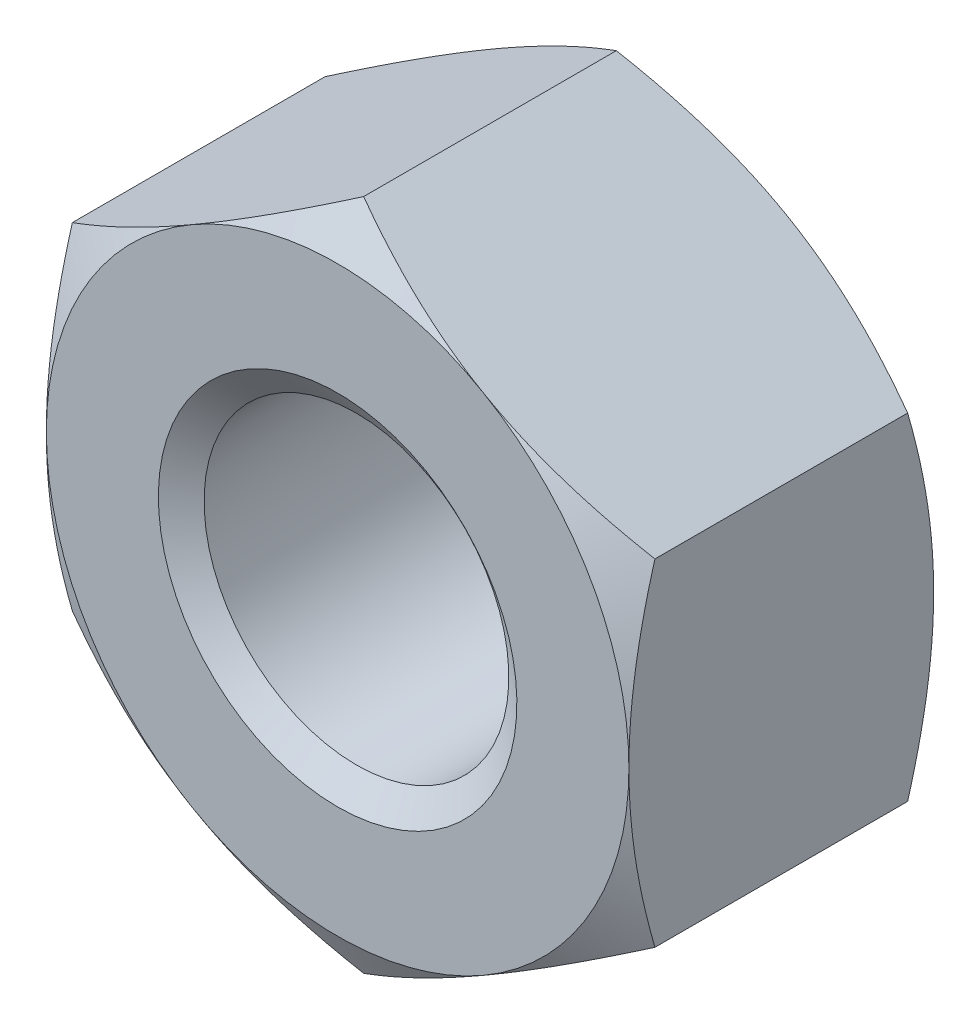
ISO-10303-21;
HEADER;
FILE_DESCRIPTION(('STEP AP214'),'2;1');
FILE_NAME('part.step','',(''),(''),'','','');
FILE_SCHEMA(('AUTOMOTIVE_DESIGN { 1 0 10303 214 1 1 1 1 }'));
ENDSEC;
DATA;
#1=APPLICATION_CONTEXT('core data for automotive mechanical design processes');
#2=APPLICATION_PROTOCOL_DEFINITION('international standard','automotive_design',2000,#1);
#3=PRODUCT_CONTEXT('',#1,'mechanical');
#4=PRODUCT('Part','Part','',(#3));
#5=PRODUCT_RELATED_PRODUCT_CATEGORY('part','',(#4));
#6=PRODUCT_DEFINITION_FORMATION('','',#4);
#7=PRODUCT_DEFINITION_CONTEXT('part definition',#1,'design');
#8=PRODUCT_DEFINITION('design','',#6,#7);
#9=PRODUCT_DEFINITION_SHAPE('','',#8);
#10=(LENGTH_UNIT() NAMED_UNIT(*) SI_UNIT(.MILLI.,.METRE.));
#11=(NAMED_UNIT(*) PLANE_ANGLE_UNIT() SI_UNIT($,.RADIAN.));
#12=(NAMED_UNIT(*) SI_UNIT($,.STERADIAN.) SOLID_ANGLE_UNIT());
#13=UNCERTAINTY_MEASURE_WITH_UNIT(LENGTH_MEASURE(1.E-05),#10,'distance_accuracy_value','');
#14=(GEOMETRIC_REPRESENTATION_CONTEXT(3) GLOBAL_UNCERTAINTY_ASSIGNED_CONTEXT((#13)) GLOBAL_UNIT_ASSIGNED_CONTEXT((#10,
#11,#12)) REPRESENTATION_CONTEXT('',''));
#15=CARTESIAN_POINT('',(0.,0.,0.));
#16=DIRECTION('',(0.,0.,1.));
#17=DIRECTION('',(1.,0.,0.));
#18=AXIS2_PLACEMENT_3D('',#15,#16,#17);
#19=CARTESIAN_POINT('',(-2.05391259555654E-12,3.21964677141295E-12,0.));
#20=DIRECTION('',(0.,0.,1.));
#21=DIRECTION('',(0.,-1.,0.));
#22=AXIS2_PLACEMENT_3D('',#19,#20,#21);
#23=CONICAL_SURFACE('',#22,4.00000000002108,0.959931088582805);
#24=CARTESIAN_POINT('',(-1.94289029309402E-12,3.21964677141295E-12,3.85247389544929E-11));
#25=DIRECTION('',(0.,0.,1.));
#26=DIRECTION('',(0.,-1.,0.));
#27=AXIS2_PLACEMENT_3D('',#24,#25,#26);
#28=CIRCLE('',#27,4.00000000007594);
#29=CARTESIAN_POINT('',(-2.0528301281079E-12,-4.0000000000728,3.85684817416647E-11));
#30=VERTEX_POINT('',#29);
#31=EDGE_CURVE('E19',#30,#30,#28,.T.);
#32=CARTESIAN_POINT('',(2.38697950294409E-12,2.27595720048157E-12,-0.420124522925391));
#33=DIRECTION('',(0.,0.,1.));
#34=DIRECTION('',(0.,-1.,0.));
#35=AXIS2_PLACEMENT_3D('',#32,#33,#34);
#36=CIRCLE('',#35,3.4000000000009);
#37=CARTESIAN_POINT('',(-2.04873047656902E-12,-3.40000000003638,-0.420124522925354));
#38=VERTEX_POINT('',#37);
#39=EDGE_CURVE('E113',#38,#38,#36,.F.);
#40=CARTESIAN_POINT('',(-2.0528301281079E-12,-4.0000000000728,3.85684817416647E-11));
#41=CARTESIAN_POINT('',(-2.05278742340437E-12,-3.99375000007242,-0.00437629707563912));
#42=CARTESIAN_POINT('',(-2.05274471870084E-12,-3.98750000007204,-0.00875259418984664));
#43=CARTESIAN_POINT('',(-2.05265930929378E-12,-3.97500000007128,-0.0175051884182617));
#44=CARTESIAN_POINT('',(-2.05261660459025E-12,-3.9687500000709,-0.0218814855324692));
#45=CARTESIAN_POINT('',(-2.05253119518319E-12,-3.95625000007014,-0.0306340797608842));
#46=CARTESIAN_POINT('',(-2.05248849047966E-12,-3.95000000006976,-0.0350103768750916));
#47=CARTESIAN_POINT('',(-2.0524030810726E-12,-3.937500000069,-0.0437629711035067));
#48=CARTESIAN_POINT('',(-2.05236037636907E-12,-3.93125000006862,-0.0481392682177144));
#49=CARTESIAN_POINT('',(-2.05227496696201E-12,-3.91875000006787,-0.0568918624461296));
#50=CARTESIAN_POINT('',(-2.05223226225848E-12,-3.91250000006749,-0.061268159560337));
#51=CARTESIAN_POINT('',(-2.05214685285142E-12,-3.90000000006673,-0.0700207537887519));
#52=CARTESIAN_POINT('',(-2.05210414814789E-12,-3.89375000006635,-0.0743970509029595));
#53=CARTESIAN_POINT('',(-2.05201873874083E-12,-3.88125000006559,-0.0831496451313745));
#54=CARTESIAN_POINT('',(-2.0519760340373E-12,-3.87500000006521,-0.087525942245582));
#55=CARTESIAN_POINT('',(-2.05189062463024E-12,-3.86250000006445,-0.0962785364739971));
#56=CARTESIAN_POINT('',(-2.05184791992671E-12,-3.85625000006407,-0.100654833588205));
#57=CARTESIAN_POINT('',(-2.05176251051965E-12,-3.84375000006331,-0.10940742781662));
#58=CARTESIAN_POINT('',(-2.05171980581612E-12,-3.83750000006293,-0.113783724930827));
#59=CARTESIAN_POINT('',(-2.05163439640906E-12,-3.82500000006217,-0.122536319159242));
#60=CARTESIAN_POINT('',(-2.05159169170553E-12,-3.81875000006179,-0.12691261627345));
#61=CARTESIAN_POINT('',(-2.05150628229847E-12,-3.80625000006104,-0.135665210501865));
#62=CARTESIAN_POINT('',(-2.05146357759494E-12,-3.80000000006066,-0.140041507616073));
#63=CARTESIAN_POINT('',(-2.05137816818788E-12,-3.7875000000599,-0.148794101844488));
#64=CARTESIAN_POINT('',(-2.05133546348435E-12,-3.78125000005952,-0.153170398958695));
#65=CARTESIAN_POINT('',(-2.05125005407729E-12,-3.76875000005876,-0.16192299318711));
#66=CARTESIAN_POINT('',(-2.05120734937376E-12,-3.76250000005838,-0.166299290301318));
#67=CARTESIAN_POINT('',(-2.0511219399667E-12,-3.75000000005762,-0.175051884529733));
#68=CARTESIAN_POINT('',(-2.05107923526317E-12,-3.74375000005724,-0.17942818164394));
#69=CARTESIAN_POINT('',(-2.05099382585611E-12,-3.73125000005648,-0.188180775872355));
#70=CARTESIAN_POINT('',(-2.05095112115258E-12,-3.7250000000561,-0.192557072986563));
#71=CARTESIAN_POINT('',(-2.05086571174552E-12,-3.71250000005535,-0.201309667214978));
#72=CARTESIAN_POINT('',(-2.05082300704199E-12,-3.70625000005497,-0.205685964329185));
#73=CARTESIAN_POINT('',(-2.05073759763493E-12,-3.69375000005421,-0.2144385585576));
#74=CARTESIAN_POINT('',(-2.0506948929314E-12,-3.68750000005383,-0.218814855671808));
#75=CARTESIAN_POINT('',(-2.05060948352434E-12,-3.67500000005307,-0.227567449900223));
#76=CARTESIAN_POINT('',(-2.05056677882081E-12,-3.66875000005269,-0.23194374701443));
#77=CARTESIAN_POINT('',(-2.05048136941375E-12,-3.65625000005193,-0.240696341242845));
#78=CARTESIAN_POINT('',(-2.05043866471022E-12,-3.65000000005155,-0.245072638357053));
#79=CARTESIAN_POINT('',(-2.05035325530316E-12,-3.63750000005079,-0.253825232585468));
#80=CARTESIAN_POINT('',(-2.05031055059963E-12,-3.63125000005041,-0.258201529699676));
#81=CARTESIAN_POINT('',(-2.05022514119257E-12,-3.61875000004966,-0.266954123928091));
#82=CARTESIAN_POINT('',(-2.05018243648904E-12,-3.61250000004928,-0.271330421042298));
#83=CARTESIAN_POINT('',(-2.05009702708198E-12,-3.60000000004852,-0.280083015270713));
#84=CARTESIAN_POINT('',(-2.05005432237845E-12,-3.59375000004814,-0.284459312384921));
#85=CARTESIAN_POINT('',(-2.04996891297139E-12,-3.58125000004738,-0.293211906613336));
#86=CARTESIAN_POINT('',(-2.04992620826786E-12,-3.575000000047,-0.297588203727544));
#87=CARTESIAN_POINT('',(-2.0498407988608E-12,-3.56250000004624,-0.306340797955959));
#88=CARTESIAN_POINT('',(-2.04979809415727E-12,-3.55625000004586,-0.310717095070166));
#89=CARTESIAN_POINT('',(-2.04971268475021E-12,-3.5437500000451,-0.319469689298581));
#90=CARTESIAN_POINT('',(-2.04966998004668E-12,-3.53750000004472,-0.323845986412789));
#91=CARTESIAN_POINT('',(-2.04958457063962E-12,-3.52500000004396,-0.332598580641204));
#92=CARTESIAN_POINT('',(-2.04954186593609E-12,-3.51875000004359,-0.336974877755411));
#93=CARTESIAN_POINT('',(-2.04945645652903E-12,-3.50625000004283,-0.345727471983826));
#94=CARTESIAN_POINT('',(-2.0494137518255E-12,-3.50000000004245,-0.350103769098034));
#95=CARTESIAN_POINT('',(-2.04932834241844E-12,-3.48750000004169,-0.358856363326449));
#96=CARTESIAN_POINT('',(-2.04928563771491E-12,-3.48125000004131,-0.363232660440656));
#97=CARTESIAN_POINT('',(-2.04920022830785E-12,-3.46875000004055,-0.371985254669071));
#98=CARTESIAN_POINT('',(-2.04915752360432E-12,-3.46250000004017,-0.376361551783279));
#99=CARTESIAN_POINT('',(-2.04907211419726E-12,-3.45000000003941,-0.385114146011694));
#100=CARTESIAN_POINT('',(-2.04902940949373E-12,-3.44375000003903,-0.389490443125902));
#101=CARTESIAN_POINT('',(-2.04894400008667E-12,-3.43125000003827,-0.398243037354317));
#102=CARTESIAN_POINT('',(-2.04890129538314E-12,-3.42500000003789,-0.402619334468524));
#103=CARTESIAN_POINT('',(-2.04881588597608E-12,-3.41250000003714,-0.411371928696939));
#104=CARTESIAN_POINT('',(-2.04877318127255E-12,-3.40625000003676,-0.415748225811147));
#105=CARTESIAN_POINT('',(-2.04873047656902E-12,-3.40000000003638,-0.420124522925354));
#106=B_SPLINE_CURVE_WITH_KNOTS('',3,(#40,#41,#42,#43,#44,#45,#46,#47,#48,#49,#50,#51,#52,#53,
#54,#55,#56,#57,#58,#59,#60,#61,#62,#63,#64,#65,#66,#67,#68,#69,#70,#71,#72,#73,#74,#75,#76,#77,
#78,#79,#80,#81,#82,#83,#84,#85,#86,#87,#88,#89,#90,#91,#92,#93,#94,#95,#96,#97,#98,#99,#100,
#101,#102,#103,#104,#105),.UNSPECIFIED.,.F.,.F.,(4,2,2,2,2,2,2,2,2,2,2,2,2,2,2,2,2,2,2,2,2,2,2,
2,2,2,2,2,2,2,2,2,4),(0.,0.0228895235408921,0.0457790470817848,0.0686685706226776,
0.091558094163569,0.114447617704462,0.137337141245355,0.160226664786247,0.183116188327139,
0.206005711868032,0.228895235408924,0.251784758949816,0.274674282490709,0.297563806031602,
0.320453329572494,0.343342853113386,0.366232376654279,0.389121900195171,0.412011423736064,
0.434900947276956,0.457790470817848,0.480679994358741,0.503569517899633,0.526459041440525,
0.549348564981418,0.572238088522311,0.595127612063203,0.618017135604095,0.640906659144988,
0.66379618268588,0.686685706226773,0.709575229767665,0.732464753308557),.UNSPECIFIED.);
#107=EDGE_CURVE('BSEAM16',#30,#38,#106,.T.);
#108=ORIENTED_EDGE('',*,*,#31,.T.);
#109=ORIENTED_EDGE('',*,*,#39,.T.);
#110=ORIENTED_EDGE('',*,*,#107,.T.);
#111=ORIENTED_EDGE('',*,*,#107,.F.);
#112=EDGE_LOOP('',(#108,#110,#109,#111));
#113=FACE_BOUND('',#112,.T.);
#114=ADVANCED_FACE('F16',(#113),#23,.F.);
#115=CARTESIAN_POINT('',(1.88737914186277E-12,7.50555349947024,-1.22124532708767E-11));
#116=DIRECTION('',(0.,0.,-0.999999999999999));
#117=DIRECTION('',(0.,1.,0.));
#118=AXIS2_PLACEMENT_3D('',#115,#116,#117);
#119=PLANE('',#118);
#120=CARTESIAN_POINT('',(0.,0.,1.52655665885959E-11));
#121=DIRECTION('',(0.,0.,-1.));
#122=DIRECTION('',(0.,1.,0.));
#123=AXIS2_PLACEMENT_3D('',#120,#121,#122);
#124=CIRCLE('',#123,6.50000000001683);
#125=CARTESIAN_POINT('',(-3.25000000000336,-5.62916512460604,2.05391259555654E-11));
#126=VERTEX_POINT('',#125);
#127=CARTESIAN_POINT('',(-6.50000000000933,6.10622663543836E-13,1.97064586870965E-11));
#128=VERTEX_POINT('',#127);
#129=EDGE_CURVE('E105',#126,#128,#124,.T.);
#130=ORIENTED_EDGE('',*,*,#129,.F.);
#131=CARTESIAN_POINT('',(0.,0.,1.52655665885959E-11));
#132=DIRECTION('',(0.,0.,-1.));
#133=DIRECTION('',(0.,1.,0.));
#134=AXIS2_PLACEMENT_3D('',#131,#132,#133);
#135=CIRCLE('',#134,6.50000000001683);
#136=CARTESIAN_POINT('',(3.25000000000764,-5.62916512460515,1.9817480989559E-11));
#137=VERTEX_POINT('',#136);
#138=EDGE_CURVE('E124',#137,#126,#135,.T.);
#139=ORIENTED_EDGE('',*,*,#138,.F.);
#140=CARTESIAN_POINT('',(0.,0.,1.52655665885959E-11));
#141=DIRECTION('',(0.,0.,-1.));
#142=DIRECTION('',(0.,1.,0.));
#143=AXIS2_PLACEMENT_3D('',#140,#141,#142);
#144=CIRCLE('',#143,6.50000000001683);
#145=CARTESIAN_POINT('',(6.50000000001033,8.88178419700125E-13,1.89293025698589E-11));
#146=VERTEX_POINT('',#145);
#147=EDGE_CURVE('E446',#146,#137,#144,.T.);
#148=ORIENTED_EDGE('',*,*,#147,.F.);
#149=CARTESIAN_POINT('',(0.,0.,1.52655665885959E-11));
#150=DIRECTION('',(0.,0.,-1.));
#151=DIRECTION('',(0.,1.,0.));
#152=AXIS2_PLACEMENT_3D('',#149,#150,#151);
#153=CIRCLE('',#152,6.50000000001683);
#154=CARTESIAN_POINT('',(3.25000000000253,5.62916512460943,1.90958360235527E-11));
#155=VERTEX_POINT('',#154);
#156=EDGE_CURVE('E445',#155,#146,#153,.T.);
#157=ORIENTED_EDGE('',*,*,#156,.F.);
#158=CARTESIAN_POINT('',(0.,0.,1.52655665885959E-11));
#159=DIRECTION('',(0.,0.,-1.));
#160=DIRECTION('',(0.,1.,0.));
#161=AXIS2_PLACEMENT_3D('',#158,#159,#160);
#162=CIRCLE('',#161,6.50000000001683);
#163=CARTESIAN_POINT('',(-3.25000000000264,5.62916512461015,1.85407245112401E-11));
#164=VERTEX_POINT('',#163);
#165=EDGE_CURVE('E108',#164,#155,#162,.T.);
#166=ORIENTED_EDGE('',*,*,#165,.F.);
#167=CARTESIAN_POINT('',(0.,0.,1.52655665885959E-11));
#168=DIRECTION('',(0.,0.,-1.));
#169=DIRECTION('',(0.,1.,0.));
#170=AXIS2_PLACEMENT_3D('',#167,#168,#169);
#171=CIRCLE('',#170,6.50000000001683);
#172=EDGE_CURVE('E101',#128,#164,#171,.T.);
#173=ORIENTED_EDGE('',*,*,#172,.F.);
#174=EDGE_LOOP('',(#130,#139,#148,#157,#166,#173));
#175=FACE_BOUND('',#174,.T.);
#176=ORIENTED_EDGE('',*,*,#31,.F.);
#177=EDGE_LOOP('',(#176));
#178=FACE_BOUND('',#177,.T.);
#179=ADVANCED_FACE('F103',(#175,#178),#119,.F.);
#180=CARTESIAN_POINT('',(2.4980018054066E-12,2.16493489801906E-12,-6.7999999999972));
#181=DIRECTION('',(0.,0.,1.));
#182=DIRECTION('',(0.,-1.,0.));
#183=AXIS2_PLACEMENT_3D('',#180,#181,#182);
#184=CYLINDRICAL_SURFACE('',#183,3.4000000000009);
#185=CARTESIAN_POINT('',(-2.94209101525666E-12,1.11022302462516E-12,-6.3544754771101));
#186=DIRECTION('',(0.,0.,-1.));
#187=DIRECTION('',(-1.,0.,0.));
#188=AXIS2_PLACEMENT_3D('',#185,#186,#187);
#189=CIRCLE('',#188,3.40000000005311);
#190=CARTESIAN_POINT('',(2.49440220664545E-12,-3.39999999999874,-6.35447547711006));
#191=VERTEX_POINT('',#190);
#192=EDGE_CURVE('E123',#191,#191,#189,.T.);
#193=CARTESIAN_POINT('',(2.43420021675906E-12,-3.39999999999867,-0.420124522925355));
#194=CARTESIAN_POINT('',(2.43482732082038E-12,-3.39999999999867,-0.481940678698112));
#195=CARTESIAN_POINT('',(2.43545442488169E-12,-3.39999999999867,-0.54375683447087));
#196=CARTESIAN_POINT('',(2.43670863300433E-12,-3.39999999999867,-0.667389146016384));
#197=CARTESIAN_POINT('',(2.43733573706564E-12,-3.39999999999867,-0.729205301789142));
#198=CARTESIAN_POINT('',(2.43858994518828E-12,-3.39999999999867,-0.852837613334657));
#199=CARTESIAN_POINT('',(2.43921704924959E-12,-3.39999999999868,-0.914653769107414));
#200=CARTESIAN_POINT('',(2.44047125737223E-12,-3.39999999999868,-1.03828608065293));
#201=CARTESIAN_POINT('',(2.44109836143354E-12,-3.39999999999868,-1.10010223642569));
#202=CARTESIAN_POINT('',(2.44235256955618E-12,-3.39999999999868,-1.2237345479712));
#203=CARTESIAN_POINT('',(2.44297967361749E-12,-3.39999999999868,-1.28555070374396));
#204=CARTESIAN_POINT('',(2.44423388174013E-12,-3.39999999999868,-1.40918301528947));
#205=CARTESIAN_POINT('',(2.44486098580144E-12,-3.39999999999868,-1.47099917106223));
#206=CARTESIAN_POINT('',(2.44611519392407E-12,-3.39999999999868,-1.59463148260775));
#207=CARTESIAN_POINT('',(2.44674229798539E-12,-3.39999999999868,-1.6564476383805));
#208=CARTESIAN_POINT('',(2.44799650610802E-12,-3.39999999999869,-1.78007994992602));
#209=CARTESIAN_POINT('',(2.44862361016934E-12,-3.39999999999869,-1.84189610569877));
#210=CARTESIAN_POINT('',(2.44987781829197E-12,-3.39999999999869,-1.96552841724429));
#211=CARTESIAN_POINT('',(2.45050492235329E-12,-3.39999999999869,-2.02734457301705));
#212=CARTESIAN_POINT('',(2.45175913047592E-12,-3.39999999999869,-2.15097688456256));
#213=CARTESIAN_POINT('',(2.45238623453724E-12,-3.39999999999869,-2.21279304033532));
#214=CARTESIAN_POINT('',(2.45364044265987E-12,-3.39999999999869,-2.33642535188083));
#215=CARTESIAN_POINT('',(2.45426754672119E-12,-3.39999999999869,-2.39824150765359));
#216=CARTESIAN_POINT('',(2.45552175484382E-12,-3.39999999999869,-2.52187381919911));
#217=CARTESIAN_POINT('',(2.45614885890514E-12,-3.39999999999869,-2.58368997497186));
#218=CARTESIAN_POINT('',(2.45740306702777E-12,-3.3999999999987,-2.70732228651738));
#219=CARTESIAN_POINT('',(2.45803017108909E-12,-3.3999999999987,-2.76913844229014));
#220=CARTESIAN_POINT('',(2.45928437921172E-12,-3.3999999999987,-2.89277075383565));
#221=CARTESIAN_POINT('',(2.45991148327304E-12,-3.3999999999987,-2.95458690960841));
#222=CARTESIAN_POINT('',(2.46116569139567E-12,-3.3999999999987,-3.07821922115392));
#223=CARTESIAN_POINT('',(2.46179279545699E-12,-3.3999999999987,-3.14003537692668));
#224=CARTESIAN_POINT('',(2.46304700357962E-12,-3.3999999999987,-3.26366768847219));
#225=CARTESIAN_POINT('',(2.46367410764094E-12,-3.3999999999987,-3.32548384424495));
#226=CARTESIAN_POINT('',(2.46492831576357E-12,-3.3999999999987,-3.44911615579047));
#227=CARTESIAN_POINT('',(2.46555541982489E-12,-3.3999999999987,-3.51093231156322));
#228=CARTESIAN_POINT('',(2.46680962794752E-12,-3.39999999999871,-3.63456462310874));
#229=CARTESIAN_POINT('',(2.46743673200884E-12,-3.39999999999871,-3.6963807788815));
#230=CARTESIAN_POINT('',(2.46869094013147E-12,-3.39999999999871,-3.82001309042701));
#231=CARTESIAN_POINT('',(2.46931804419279E-12,-3.39999999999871,-3.88182924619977));
#232=CARTESIAN_POINT('',(2.47057225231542E-12,-3.39999999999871,-4.00546155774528));
#233=CARTESIAN_POINT('',(2.47119935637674E-12,-3.39999999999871,-4.06727771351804));
#234=CARTESIAN_POINT('',(2.47245356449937E-12,-3.39999999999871,-4.19091002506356));
#235=CARTESIAN_POINT('',(2.47308066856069E-12,-3.39999999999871,-4.25272618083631));
#236=CARTESIAN_POINT('',(2.47433487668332E-12,-3.39999999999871,-4.37635849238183));
#237=CARTESIAN_POINT('',(2.47496198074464E-12,-3.39999999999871,-4.43817464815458));
#238=CARTESIAN_POINT('',(2.47621618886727E-12,-3.39999999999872,-4.5618069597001));
#239=CARTESIAN_POINT('',(2.47684329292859E-12,-3.39999999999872,-4.62362311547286));
#240=CARTESIAN_POINT('',(2.47809750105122E-12,-3.39999999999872,-4.74725542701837));
#241=CARTESIAN_POINT('',(2.47872460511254E-12,-3.39999999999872,-4.80907158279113));
#242=CARTESIAN_POINT('',(2.47997881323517E-12,-3.39999999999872,-4.93270389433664));
#243=CARTESIAN_POINT('',(2.48060591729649E-12,-3.39999999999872,-4.9945200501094));
#244=CARTESIAN_POINT('',(2.48186012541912E-12,-3.39999999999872,-5.11815236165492));
#245=CARTESIAN_POINT('',(2.48248722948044E-12,-3.39999999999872,-5.17996851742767));
#246=CARTESIAN_POINT('',(2.48374143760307E-12,-3.39999999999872,-5.30360082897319));
#247=CARTESIAN_POINT('',(2.48436854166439E-12,-3.39999999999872,-5.36541698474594));
#248=CARTESIAN_POINT('',(2.48562274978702E-12,-3.39999999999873,-5.48904929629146));
#249=CARTESIAN_POINT('',(2.48624985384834E-12,-3.39999999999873,-5.55086545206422));
#250=CARTESIAN_POINT('',(2.48750406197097E-12,-3.39999999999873,-5.67449776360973));
#251=CARTESIAN_POINT('',(2.48813116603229E-12,-3.39999999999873,-5.73631391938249));
#252=CARTESIAN_POINT('',(2.48938537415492E-12,-3.39999999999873,-5.859946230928));
#253=CARTESIAN_POINT('',(2.49001247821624E-12,-3.39999999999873,-5.92176238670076));
#254=CARTESIAN_POINT('',(2.49126668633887E-12,-3.39999999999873,-6.04539469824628));
#255=CARTESIAN_POINT('',(2.49189379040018E-12,-3.39999999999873,-6.10721085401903));
#256=CARTESIAN_POINT('',(2.49314799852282E-12,-3.39999999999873,-6.23084316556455));
#257=CARTESIAN_POINT('',(2.49377510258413E-12,-3.39999999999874,-6.2926593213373));
#258=CARTESIAN_POINT('',(2.49440220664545E-12,-3.39999999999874,-6.35447547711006));
#259=B_SPLINE_CURVE_WITH_KNOTS('',3,(#193,#194,#195,#196,#197,#198,#199,#200,#201,#202,#203,
#204,#205,#206,#207,#208,#209,#210,#211,#212,#213,#214,#215,#216,#217,#218,#219,#220,#221,#222,
#223,#224,#225,#226,#227,#228,#229,#230,#231,#232,#233,#234,#235,#236,#237,#238,#239,#240,#241,
#242,#243,#244,#245,#246,#247,#248,#249,#250,#251,#252,#253,#254,#255,#256,#257,#258),
.UNSPECIFIED.,.F.,.F.,(4,2,2,2,2,2,2,2,2,2,2,2,2,2,2,2,2,2,2,2,2,2,2,2,2,2,2,2,2,2,2,2,4),(0.,
0.185448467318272,0.370896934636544,0.556345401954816,0.741793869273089,0.927242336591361,
1.11269080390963,1.2981392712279,1.48358773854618,1.66903620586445,1.85448467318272,
2.03993314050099,2.22538160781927,2.41083007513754,2.59627854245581,2.78172700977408,
2.96717547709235,3.15262394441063,3.3380724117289,3.52352087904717,3.70896934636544,
3.89441781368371,4.07986628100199,4.26531474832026,4.45076321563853,4.6362116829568,
4.82166015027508,5.00710861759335,5.19255708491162,5.37800555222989,5.56345401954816,
5.74890248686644,5.93435095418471),.UNSPECIFIED.);
#260=EDGE_CURVE('BSEAM477',#38,#191,#259,.T.);
#261=ORIENTED_EDGE('',*,*,#39,.F.);
#262=ORIENTED_EDGE('',*,*,#192,.T.);
#263=ORIENTED_EDGE('',*,*,#260,.T.);
#264=ORIENTED_EDGE('',*,*,#260,.F.);
#265=EDGE_LOOP('',(#261,#263,#262,#264));
#266=FACE_BOUND('',#265,.T.);
#267=ADVANCED_FACE('F477',(#266),#184,.F.);
#268=CARTESIAN_POINT('',(0.,0.,-0.584039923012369));
#269=DIRECTION('',(0.,0.,-1.));
#270=DIRECTION('',(0.,1.,0.));
#271=AXIS2_PLACEMENT_3D('',#268,#269,#270);
#272=CONICAL_SURFACE('',#271,7.51158682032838,1.04719755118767);
#273=ORIENTED_EDGE('',*,*,#172,.T.);
#274=CARTESIAN_POINT('',(-6.50000000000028,3.75277674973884,-0.580556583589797));
#275=CARTESIAN_POINT('',(-6.2354513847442,3.90551396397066,-0.492351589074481));
#276=CARTESIAN_POINT('',(-5.96878416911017,4.059474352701,-0.411540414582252));
#277=CARTESIAN_POINT('',(-5.43309909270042,4.368752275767,-0.269031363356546));
#278=CARTESIAN_POINT('',(-5.16409991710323,4.5240590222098,-0.207238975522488));
#279=CARTESIAN_POINT('',(-4.75806245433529,4.75848486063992,-0.131368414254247));
#280=CARTESIAN_POINT('',(-4.62220372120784,4.83692293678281,-0.108872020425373));
#281=CARTESIAN_POINT('',(-4.3498358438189,4.9941746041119,-0.0699302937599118));
#282=CARTESIAN_POINT('',(-4.21332671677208,5.07298818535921,-0.0534848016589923));
#283=CARTESIAN_POINT('',(-3.93915312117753,5.2312823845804,-0.0269338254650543));
#284=CARTESIAN_POINT('',(-3.80148629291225,5.31076436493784,-0.0168605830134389));
#285=CARTESIAN_POINT('',(-3.52588189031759,5.46988464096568,-0.0033797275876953));
#286=CARTESIAN_POINT('',(-3.38794426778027,5.54952296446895,2.6565279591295E-05));
#287=CARTESIAN_POINT('',(-3.24999999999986,5.6291651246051,2.17603712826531E-11));
#288=B_SPLINE_CURVE_WITH_KNOTS('',3,(#274,#275,#276,#277,#278,#279,#280,#281,#282,#283,#284,
#285,#286,#287),.UNSPECIFIED.,.F.,.F.,(4,2,2,2,2,2,4),(0.,0.954247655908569,1.90367376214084,
2.37900973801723,2.85433320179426,3.33204281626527,3.80984701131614),.UNSPECIFIED.);
#289=CARTESIAN_POINT('',(-6.50000000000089,3.75277674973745,-0.580556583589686));
#290=VERTEX_POINT('',#289);
#291=EDGE_CURVE('E129',#290,#164,#288,.T.);
#292=ORIENTED_EDGE('',*,*,#291,.F.);
#293=CARTESIAN_POINT('',(-6.50000000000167,1.27675647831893E-12,2.40918396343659E-11));
#294=CARTESIAN_POINT('',(-6.50000000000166,0.159284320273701,2.65652817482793E-05));
#295=CARTESIAN_POINT('',(-6.50000000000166,0.318560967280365,-0.00337972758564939));
#296=CARTESIAN_POINT('',(-6.50000000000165,0.636801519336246,-0.0168605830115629));
#297=CARTESIAN_POINT('',(-6.50000000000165,0.795765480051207,-0.0269338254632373));
#298=CARTESIAN_POINT('',(-6.50000000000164,1.11235387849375,-0.0534848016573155));
#299=CARTESIAN_POINT('',(-6.50000000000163,1.26998104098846,-0.0699302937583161));
#300=CARTESIAN_POINT('',(-6.50000000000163,1.58448437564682,-0.10887202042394));
#301=CARTESIAN_POINT('',(-6.50000000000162,1.74136052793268,-0.131368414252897));
#302=CARTESIAN_POINT('',(-6.50000000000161,2.21021220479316,-0.207238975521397));
#303=CARTESIAN_POINT('',(-6.5000000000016,2.52082569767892,-0.269031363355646));
#304=CARTESIAN_POINT('',(-6.50000000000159,3.13938154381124,-0.411540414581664));
#305=CARTESIAN_POINT('',(-6.50000000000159,3.44730232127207,-0.492351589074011));
#306=CARTESIAN_POINT('',(-6.50000000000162,3.7527767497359,-0.580556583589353));
#307=B_SPLINE_CURVE_WITH_KNOTS('',3,(#293,#294,#295,#296,#297,#298,#299,#300,#301,#302,#303,
#304,#305,#306),.UNSPECIFIED.,.F.,.F.,(4,2,2,2,2,2,4),(0.,0.477804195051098,0.955513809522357,
1.43083727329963,1.90617324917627,2.85559935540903,3.80984701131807),.UNSPECIFIED.);
#308=EDGE_CURVE('E126',#128,#290,#307,.T.);
#309=ORIENTED_EDGE('',*,*,#308,.F.);
#310=EDGE_LOOP('',(#273,#292,#309));
#311=FACE_BOUND('',#310,.T.);
#312=ADVANCED_FACE('F127',(#311),#272,.T.);
#313=CARTESIAN_POINT('',(0.,0.,-0.584039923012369));
#314=DIRECTION('',(0.,0.,-1.));
#315=DIRECTION('',(0.,1.,0.));
#316=AXIS2_PLACEMENT_3D('',#313,#314,#315);
#317=CONICAL_SURFACE('',#316,7.51158682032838,1.04719755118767);
#318=CARTESIAN_POINT('',(-7.43849426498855E-12,7.50555349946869,-0.580556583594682));
#319=CARTESIAN_POINT('',(0.264548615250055,7.35281628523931,-0.492351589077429));
#320=CARTESIAN_POINT('',(0.531215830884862,7.19885589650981,-0.411540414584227));
#321=CARTESIAN_POINT('',(1.06690090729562,6.88957797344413,-0.269031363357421));
#322=CARTESIAN_POINT('',(1.33590008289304,6.7342712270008,-0.207238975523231));
#323=CARTESIAN_POINT('',(1.74193754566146,6.49984538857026,-0.131368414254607));
#324=CARTESIAN_POINT('',(1.87779627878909,6.4214073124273,-0.108872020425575));
#325=CARTESIAN_POINT('',(2.15016415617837,6.26415564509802,-0.069930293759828));
#326=CARTESIAN_POINT('',(2.28667328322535,6.1853420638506,-0.05348480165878));
#327=CARTESIAN_POINT('',(2.56084687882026,6.02704786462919,-0.0269338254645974));
#328=CARTESIAN_POINT('',(2.69851370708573,5.94756588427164,-0.0168605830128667));
#329=CARTESIAN_POINT('',(2.97411810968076,5.78844560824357,-0.00337972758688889));
#330=CARTESIAN_POINT('',(3.11205573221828,5.70880728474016,2.65652805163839E-05));
#331=CARTESIAN_POINT('',(3.24999999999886,5.62916512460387,2.2815083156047E-11));
#332=B_SPLINE_CURVE_WITH_KNOTS('',3,(#318,#319,#320,#321,#322,#323,#324,#325,#326,#327,#328,
#329,#330,#331),.UNSPECIFIED.,.F.,.F.,(4,2,2,2,2,2,4),(0.,0.954247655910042,1.90367376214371,
2.37900973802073,2.8543332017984,3.33204281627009,3.80984701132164),.UNSPECIFIED.);
#333=CARTESIAN_POINT('',(-8.32667268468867E-13,7.50555349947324,-0.580556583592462));
#334=VERTEX_POINT('',#333);
#335=EDGE_CURVE('E310',#334,#155,#332,.T.);
#336=ORIENTED_EDGE('',*,*,#335,.F.);
#337=CARTESIAN_POINT('',(-3.24999999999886,5.62916512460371,2.08721928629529E-11));
#338=CARTESIAN_POINT('',(-3.11205573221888,5.70880728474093,2.65652791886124E-05));
#339=CARTESIAN_POINT('',(-2.97411810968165,5.7884456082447,-0.0033797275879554));
#340=CARTESIAN_POINT('',(-2.69851370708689,5.94756588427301,-0.0168605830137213));
#341=CARTESIAN_POINT('',(-2.56084687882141,6.02704786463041,-0.0269338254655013));
#342=CARTESIAN_POINT('',(-2.28667328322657,6.18534206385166,-0.0534848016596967));
#343=CARTESIAN_POINT('',(-2.15016415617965,6.26415564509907,-0.069930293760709));
#344=CARTESIAN_POINT('',(-1.87779627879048,6.42140731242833,-0.108872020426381));
#345=CARTESIAN_POINT('',(-1.7419375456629,6.49984538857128,-0.131368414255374));
#346=CARTESIAN_POINT('',(-1.33590008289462,6.73427122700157,-0.207238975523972));
#347=CARTESIAN_POINT('',(-1.06690090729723,6.8895779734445,-0.269031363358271));
#348=CARTESIAN_POINT('',(-0.531215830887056,7.19885589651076,-0.411540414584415));
#349=CARTESIAN_POINT('',(-0.264548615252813,7.35281628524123,-0.492351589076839));
#350=CARTESIAN_POINT('',(3.49720252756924E-12,7.50555349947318,-0.580556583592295));
#351=B_SPLINE_CURVE_WITH_KNOTS('',3,(#337,#338,#339,#340,#341,#342,#343,#344,#345,#346,#347,
#348,#349,#350),.UNSPECIFIED.,.F.,.F.,(4,2,2,2,2,2,4),(0.,0.477804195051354,0.955513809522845,
1.43083727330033,1.90617324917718,2.8555993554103,3.80984701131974),.UNSPECIFIED.);
#352=EDGE_CURVE('E305',#164,#334,#351,.T.);
#353=ORIENTED_EDGE('',*,*,#352,.F.);
#354=ORIENTED_EDGE('',*,*,#165,.T.);
#355=EDGE_LOOP('',(#336,#353,#354));
#356=FACE_BOUND('',#355,.T.);
#357=ADVANCED_FACE('F294',(#356),#317,.T.);
#358=CARTESIAN_POINT('',(0.,0.,-0.584039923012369));
#359=DIRECTION('',(0.,0.,-1.));
#360=DIRECTION('',(0.,1.,0.));
#361=AXIS2_PLACEMENT_3D('',#358,#359,#360);
#362=CONICAL_SURFACE('',#361,7.51158682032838,1.04719755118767);
#363=CARTESIAN_POINT('',(6.49999999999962,7.7715611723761E-13,2.04836148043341E-11));
#364=CARTESIAN_POINT('',(6.50000000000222,0.159284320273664,2.65652797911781E-05));
#365=CARTESIAN_POINT('',(6.50000000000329,0.318560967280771,-0.00337972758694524));
#366=CARTESIAN_POINT('',(6.50000000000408,0.636801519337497,-0.0168605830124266));
#367=CARTESIAN_POINT('',(6.5000000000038,0.795765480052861,-0.026933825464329));
#368=CARTESIAN_POINT('',(6.5000000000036,1.11235387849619,-0.0534848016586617));
#369=CARTESIAN_POINT('',(6.50000000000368,1.26998104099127,-0.0699302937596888));
#370=CARTESIAN_POINT('',(6.50000000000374,1.58448437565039,-0.108872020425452));
#371=CARTESIAN_POINT('',(6.50000000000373,1.74136052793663,-0.131368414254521));
#372=CARTESIAN_POINT('',(6.50000000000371,2.21021220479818,-0.207238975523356));
#373=CARTESIAN_POINT('',(6.50000000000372,2.52082569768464,-0.26903136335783));
#374=CARTESIAN_POINT('',(6.50000000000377,3.13938154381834,-0.411540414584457));
#375=CARTESIAN_POINT('',(6.50000000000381,3.44730232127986,-0.492351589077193));
#376=CARTESIAN_POINT('',(6.50000000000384,3.75277674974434,-0.580556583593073));
#377=B_SPLINE_CURVE_WITH_KNOTS('',3,(#363,#364,#365,#366,#367,#368,#369,#370,#371,#372,#373,
#374,#375,#376),.UNSPECIFIED.,.F.,.F.,(4,2,2,2,2,2,4),(0.,0.477804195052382,0.955513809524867,
1.43083727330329,1.90617324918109,2.85559935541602,3.80984701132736),.UNSPECIFIED.);
#378=CARTESIAN_POINT('',(6.50000000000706,3.75277674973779,-0.58055658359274));
#379=VERTEX_POINT('',#378);
#380=EDGE_CURVE('E275',#146,#379,#377,.T.);
#381=ORIENTED_EDGE('',*,*,#380,.T.);
#382=CARTESIAN_POINT('',(3.24999999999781,5.62916512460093,2.10387263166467E-11));
#383=CARTESIAN_POINT('',(3.38794426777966,5.54952296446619,2.6565279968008E-05));
#384=CARTESIAN_POINT('',(3.52588189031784,5.46988464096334,-0.00337972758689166));
#385=CARTESIAN_POINT('',(3.80148629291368,5.31076436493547,-0.0168605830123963));
#386=CARTESIAN_POINT('',(3.93915312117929,5.23128238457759,-0.026933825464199));
#387=CARTESIAN_POINT('',(4.21332671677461,5.07298818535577,-0.0534848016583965));
#388=CARTESIAN_POINT('',(4.34983584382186,4.99417460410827,-0.0699302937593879));
#389=CARTESIAN_POINT('',(4.62220372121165,4.83692293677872,-0.108872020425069));
#390=CARTESIAN_POINT('',(4.75806245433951,4.75848486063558,-0.131368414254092));
#391=CARTESIAN_POINT('',(5.16409991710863,4.52405902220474,-0.207238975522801));
#392=CARTESIAN_POINT('',(5.43309909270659,4.36875227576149,-0.269031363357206));
#393=CARTESIAN_POINT('',(5.96878416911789,4.05947435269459,-0.411540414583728));
#394=CARTESIAN_POINT('',(6.23545138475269,3.9055139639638,-0.492351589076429));
#395=CARTESIAN_POINT('',(6.5000000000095,3.75277674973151,-0.580556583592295));
#396=B_SPLINE_CURVE_WITH_KNOTS('',3,(#382,#383,#384,#385,#386,#387,#388,#389,#390,#391,#392,
#393,#394,#395),.UNSPECIFIED.,.F.,.F.,(4,2,2,2,2,2,4),(0.,0.477804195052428,0.955513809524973,
1.43083727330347,1.90617324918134,2.85559935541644,3.80984701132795),.UNSPECIFIED.);
#397=EDGE_CURVE('E283',#155,#379,#396,.T.);
#398=ORIENTED_EDGE('',*,*,#397,.F.);
#399=ORIENTED_EDGE('',*,*,#156,.T.);
#400=EDGE_LOOP('',(#381,#398,#399));
#401=FACE_BOUND('',#400,.T.);
#402=ADVANCED_FACE('F289',(#401),#362,.T.);
#403=CARTESIAN_POINT('',(0.,0.,-0.584039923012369));
#404=DIRECTION('',(0.,0.,-1.));
#405=DIRECTION('',(0.,1.,0.));
#406=AXIS2_PLACEMENT_3D('',#403,#404,#405);
#407=CONICAL_SURFACE('',#406,7.51158682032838,1.04719755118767);
#408=ORIENTED_EDGE('',*,*,#147,.T.);
#409=CARTESIAN_POINT('',(6.50000000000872,-3.75277674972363,-0.580556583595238));
#410=CARTESIAN_POINT('',(6.23545138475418,-3.90551396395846,-0.492351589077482));
#411=CARTESIAN_POINT('',(5.96878416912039,-4.0594743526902,-0.411540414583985));
#412=CARTESIAN_POINT('',(5.43309909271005,-4.36875227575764,-0.269031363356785));
#413=CARTESIAN_POINT('',(5.16409991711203,-4.52405902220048,-0.207238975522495));
#414=CARTESIAN_POINT('',(4.75806245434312,-4.758484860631,-0.131368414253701));
#415=CARTESIAN_POINT('',(4.6222037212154,-4.83692293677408,-0.108872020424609));
#416=CARTESIAN_POINT('',(4.34983584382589,-4.99417460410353,-0.0699302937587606));
#417=CARTESIAN_POINT('',(4.21332671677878,-5.072988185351,-0.053484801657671));
#418=CARTESIAN_POINT('',(3.93915312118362,-5.23128238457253,-0.0269338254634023));
#419=CARTESIAN_POINT('',(3.80148629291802,-5.31076436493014,-0.0168605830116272));
#420=CARTESIAN_POINT('',(3.52588189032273,-5.46988464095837,-0.0033797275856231));
#421=CARTESIAN_POINT('',(3.38794426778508,-5.54952296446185,2.65652817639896E-05));
#422=CARTESIAN_POINT('',(3.25000000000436,-5.62916512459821,2.39808173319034E-11));
#423=B_SPLINE_CURVE_WITH_KNOTS('',3,(#409,#410,#411,#412,#413,#414,#415,#416,#417,#418,#419,
#420,#421,#422),.UNSPECIFIED.,.F.,.F.,(4,2,2,2,2,2,4),(0.,0.954247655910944,1.90367376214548,
2.37900973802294,2.85433320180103,3.33204281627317,3.80984701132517),.UNSPECIFIED.);
#424=CARTESIAN_POINT('',(6.50000000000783,-3.75277674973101,-0.580556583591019));
#425=VERTEX_POINT('',#424);
#426=EDGE_CURVE('E379',#425,#137,#423,.T.);
#427=ORIENTED_EDGE('',*,*,#426,.F.);
#428=CARTESIAN_POINT('',(6.50000000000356,-3.75277674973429,-0.580556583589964));
#429=CARTESIAN_POINT('',(6.50000000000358,-3.4473023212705,-0.492351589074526));
#430=CARTESIAN_POINT('',(6.5000000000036,-3.13938154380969,-0.411540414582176));
#431=CARTESIAN_POINT('',(6.50000000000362,-2.52082569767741,-0.269031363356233));
#432=CARTESIAN_POINT('',(6.50000000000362,-2.21021220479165,-0.207238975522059));
#433=CARTESIAN_POINT('',(6.50000000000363,-1.7413605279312,-0.131368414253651));
#434=CARTESIAN_POINT('',(6.50000000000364,-1.58448437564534,-0.108872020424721));
#435=CARTESIAN_POINT('',(6.50000000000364,-1.269981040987,-0.0699302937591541));
#436=CARTESIAN_POINT('',(6.50000000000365,-1.11235387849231,-0.0534848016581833));
#437=CARTESIAN_POINT('',(6.50000000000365,-0.79576548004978,-0.0269338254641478));
#438=CARTESIAN_POINT('',(6.50000000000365,-0.636801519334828,-0.0168605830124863));
#439=CARTESIAN_POINT('',(6.50000000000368,-0.318560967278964,-0.00337972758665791));
#440=CARTESIAN_POINT('',(6.50000000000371,-0.159284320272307,2.65652806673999E-05));
#441=CARTESIAN_POINT('',(6.50000000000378,1.11022302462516E-13,2.28705943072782E-11));
#442=B_SPLINE_CURVE_WITH_KNOTS('',3,(#428,#429,#430,#431,#432,#433,#434,#435,#436,#437,#438,
#439,#440,#441),.UNSPECIFIED.,.F.,.F.,(4,2,2,2,2,2,4),(0.,0.954247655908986,1.90367376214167,
2.37900973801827,2.85433320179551,3.33204281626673,3.8098470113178),.UNSPECIFIED.);
#443=EDGE_CURVE('E267',#425,#146,#442,.T.);
#444=ORIENTED_EDGE('',*,*,#443,.T.);
#445=EDGE_LOOP('',(#408,#427,#444));
#446=FACE_BOUND('',#445,.T.);
#447=ADVANCED_FACE('F293',(#446),#407,.T.);
#448=CARTESIAN_POINT('',(0.,1.11022302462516E-13,-0.58403992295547));
#449=DIRECTION('',(0.,0.,-1.));
#450=DIRECTION('',(0.,1.,0.));
#451=AXIS2_PLACEMENT_3D('',#448,#449,#450);
#452=CONICAL_SURFACE('',#451,7.51158682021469,1.04719755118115);
#453=CARTESIAN_POINT('',(-5.88418203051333E-12,-7.5055534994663,-0.580556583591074));
#454=CARTESIAN_POINT('',(-0.264548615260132,-7.35281628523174,-0.492351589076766));
#455=CARTESIAN_POINT('',(-0.531215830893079,-7.19885589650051,-0.411540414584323));
#456=CARTESIAN_POINT('',(-1.06690090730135,-6.88957797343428,-0.269031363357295));
#457=CARTESIAN_POINT('',(-1.33590008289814,-6.73427122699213,-0.207238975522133));
#458=CARTESIAN_POINT('',(-1.74193754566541,-6.49984538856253,-0.1313684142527));
#459=CARTESIAN_POINT('',(-1.87779627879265,-6.42140731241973,-0.108872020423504));
#460=CARTESIAN_POINT('',(-2.15016415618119,-6.26415564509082,-0.0699302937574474));
#461=CARTESIAN_POINT('',(-2.28667328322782,-6.18534206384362,-0.0534848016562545));
#462=CARTESIAN_POINT('',(-2.56084687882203,-6.02704786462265,-0.0269338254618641));
#463=CARTESIAN_POINT('',(-2.69851370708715,-5.94756588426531,-0.0168605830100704));
#464=CARTESIAN_POINT('',(-2.97411810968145,-5.78844560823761,-0.00337972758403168));
#465=CARTESIAN_POINT('',(-3.11205573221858,-5.70880728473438,2.65652833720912E-05));
#466=CARTESIAN_POINT('',(-3.24999999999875,-5.62916512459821,2.56461518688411E-11));
#467=B_SPLINE_CURVE_WITH_KNOTS('',3,(#453,#454,#455,#456,#457,#458,#459,#460,#461,#462,#463,
#464,#465,#466),.UNSPECIFIED.,.F.,.F.,(4,2,2,2,2,2,4),(0.,0.954247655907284,1.90367376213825,
2.37900973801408,2.85433320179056,3.33204281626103,3.80984701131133),.UNSPECIFIED.);
#468=CARTESIAN_POINT('',(3.71924713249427E-12,-7.50555349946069,-0.58055658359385));
#469=VERTEX_POINT('',#468);
#470=EDGE_CURVE('E172',#469,#126,#467,.T.);
#471=ORIENTED_EDGE('',*,*,#470,.F.);
#472=CARTESIAN_POINT('',(3.25000000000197,-5.6291651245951,2.19824158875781E-11));
#473=CARTESIAN_POINT('',(3.112055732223,-5.70880728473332,2.65652811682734E-05));
#474=CARTESIAN_POINT('',(2.97411810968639,-5.78844560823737,-0.00337972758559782));
#475=CARTESIAN_POINT('',(2.69851370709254,-5.94756588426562,-0.0168605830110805));
#476=CARTESIAN_POINT('',(2.56084687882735,-6.02704786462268,-0.0269338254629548));
#477=CARTESIAN_POINT('',(2.2866732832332,-6.1853420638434,-0.0534848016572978));
#478=CARTESIAN_POINT('',(2.15016415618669,-6.26415564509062,-0.0699302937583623));
#479=CARTESIAN_POINT('',(1.87779627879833,-6.42140731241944,-0.108872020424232));
#480=CARTESIAN_POINT('',(1.74193754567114,-6.49984538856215,-0.13136841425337));
#481=CARTESIAN_POINT('',(1.33590008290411,-6.73427122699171,-0.207238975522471));
#482=CARTESIAN_POINT('',(1.0669009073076,-6.88957797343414,-0.269031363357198));
#483=CARTESIAN_POINT('',(0.531215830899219,-7.19885589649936,-0.411540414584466));
#484=CARTESIAN_POINT('',(0.264548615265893,-7.35281628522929,-0.49235158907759));
#485=CARTESIAN_POINT('',(1.0547118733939E-11,-7.50555349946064,-0.580556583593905));
#486=B_SPLINE_CURVE_WITH_KNOTS('',3,(#472,#473,#474,#475,#476,#477,#478,#479,#480,#481,#482,
#483,#484,#485),.UNSPECIFIED.,.F.,.F.,(4,2,2,2,2,2,4),(0.,0.477804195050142,0.955513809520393,
1.43083727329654,1.90617324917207,2.85559935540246,3.80984701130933),.UNSPECIFIED.);
#487=EDGE_CURVE('E380',#137,#469,#486,.T.);
#488=ORIENTED_EDGE('',*,*,#487,.F.);
#489=ORIENTED_EDGE('',*,*,#138,.T.);
#490=EDGE_LOOP('',(#471,#488,#489));
#491=FACE_BOUND('',#490,.T.);
#492=ADVANCED_FACE('F160',(#491),#452,.T.);
#493=CARTESIAN_POINT('',(0.,1.11022302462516E-13,-0.58403992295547));
#494=DIRECTION('',(0.,0.,-1.));
#495=DIRECTION('',(0.,1.,0.));
#496=AXIS2_PLACEMENT_3D('',#493,#494,#495);
#497=CONICAL_SURFACE('',#496,7.51158682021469,1.04719755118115);
#498=CARTESIAN_POINT('',(-6.50000000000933,-3.75277674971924,-0.580556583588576));
#499=CARTESIAN_POINT('',(-6.50000000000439,-3.44730232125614,-0.492351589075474));
#500=CARTESIAN_POINT('',(-6.50000000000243,-3.13938154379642,-0.411540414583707));
#501=CARTESIAN_POINT('',(-6.50000000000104,-2.52082569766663,-0.269031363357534));
#502=CARTESIAN_POINT('',(-6.50000000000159,-2.21021220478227,-0.207238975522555));
#503=CARTESIAN_POINT('',(-6.50000000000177,-1.74136052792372,-0.131368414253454));
#504=CARTESIAN_POINT('',(-6.50000000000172,-1.58448437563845,-0.108872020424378));
#505=CARTESIAN_POINT('',(-6.50000000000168,-1.26998104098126,-0.0699302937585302));
#506=CARTESIAN_POINT('',(-6.50000000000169,-1.11235387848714,-0.0534848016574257));
#507=CARTESIAN_POINT('',(-6.50000000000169,-0.795765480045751,-0.0269338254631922));
#508=CARTESIAN_POINT('',(-6.50000000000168,-0.636801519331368,-0.0168605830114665));
#509=CARTESIAN_POINT('',(-6.50000000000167,-0.318560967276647,-0.0033797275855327));
#510=CARTESIAN_POINT('',(-6.50000000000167,-0.159284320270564,2.65652818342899E-05));
#511=CARTESIAN_POINT('',(-6.50000000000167,1.27675647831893E-12,2.40918396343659E-11));
#512=B_SPLINE_CURVE_WITH_KNOTS('',3,(#498,#499,#500,#501,#502,#503,#504,#505,#506,#507,#508,
#509,#510,#511),.UNSPECIFIED.,.F.,.F.,(4,2,2,2,2,2,4),(0.,0.954247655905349,1.90367376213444,
2.37900973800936,2.85433320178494,3.33204281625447,3.80984701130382),.UNSPECIFIED.);
#513=CARTESIAN_POINT('',(-6.50000000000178,-3.75277674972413,-0.580556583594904));
#514=VERTEX_POINT('',#513);
#515=EDGE_CURVE('E118',#514,#128,#512,.T.);
#516=ORIENTED_EDGE('',*,*,#515,.F.);
#517=CARTESIAN_POINT('',(-3.24999999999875,-5.62916512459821,2.56461518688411E-11));
#518=CARTESIAN_POINT('',(-3.38794426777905,-5.54952296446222,2.65652833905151E-05));
#519=CARTESIAN_POINT('',(-3.52588189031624,-5.46988464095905,-0.00337972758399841));
#520=CARTESIAN_POINT('',(-3.8014862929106,-5.31076436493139,-0.0168605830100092));
#521=CARTESIAN_POINT('',(-3.93915312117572,-5.23128238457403,-0.0269338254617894));
#522=CARTESIAN_POINT('',(-4.21332671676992,-5.07298818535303,-0.0534848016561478));
#523=CARTESIAN_POINT('',(-4.34983584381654,-4.99417460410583,-0.0699302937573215));
#524=CARTESIAN_POINT('',(-4.62220372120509,-4.83692293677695,-0.108872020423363));
#525=CARTESIAN_POINT('',(-4.75806245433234,-4.75848486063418,-0.131368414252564));
#526=CARTESIAN_POINT('',(-5.16409991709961,-4.52405902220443,-0.207238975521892));
#527=CARTESIAN_POINT('',(-5.4330990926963,-4.36875227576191,-0.269031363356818));
#528=CARTESIAN_POINT('',(-5.96878416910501,-4.05947435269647,-0.41154041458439));
#529=CARTESIAN_POINT('',(-6.23545138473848,-3.90551396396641,-0.492351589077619));
#530=CARTESIAN_POINT('',(-6.49999999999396,-3.75277674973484,-0.580556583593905));
#531=B_SPLINE_CURVE_WITH_KNOTS('',3,(#517,#518,#519,#520,#521,#522,#523,#524,#525,#526,#527,
#528,#529,#530),.UNSPECIFIED.,.F.,.F.,(4,2,2,2,2,2,4),(0.,0.477804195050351,0.95551380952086,
1.43083727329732,1.90617324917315,2.85559935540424,3.80984701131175),.UNSPECIFIED.);
#532=EDGE_CURVE('E121',#126,#514,#531,.T.);
#533=ORIENTED_EDGE('',*,*,#532,.F.);
#534=ORIENTED_EDGE('',*,*,#129,.T.);
#535=EDGE_LOOP('',(#516,#533,#534));
#536=FACE_BOUND('',#535,.T.);
#537=ADVANCED_FACE('F116',(#536),#497,.T.);
#538=CARTESIAN_POINT('',(-2.94209101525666E-12,1.11022302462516E-12,-6.77459999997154));
#539=DIRECTION('',(0.,0.,-0.999999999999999));
#540=DIRECTION('',(0.,1.,0.));
#541=AXIS2_PLACEMENT_3D('',#538,#539,#540);
#542=CONICAL_SURFACE('',#541,3.9999999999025,0.959931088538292);
#543=CARTESIAN_POINT('',(-1.72084568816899E-12,1.22124532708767E-12,-6.7745999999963));
#544=DIRECTION('',(0.,0.,1.));
#545=DIRECTION('',(0.,-1.,0.));
#546=AXIS2_PLACEMENT_3D('',#543,#544,#545);
#547=CIRCLE('',#546,4.00000000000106);
#548=CARTESIAN_POINT('',(-1.905034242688E-12,-3.99999999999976,-6.77459999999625));
#549=VERTEX_POINT('',#548);
#550=EDGE_CURVE('E327',#549,#549,#547,.F.);
#551=ORIENTED_EDGE('',*,*,#550,.T.);
#552=EDGE_LOOP('',(#551));
#553=FACE_BOUND('',#552,.T.);
#554=ORIENTED_EDGE('',*,*,#192,.F.);
#555=EDGE_LOOP('',(#554));
#556=FACE_BOUND('',#555,.T.);
#557=ADVANCED_FACE('F159',(#553,#556),#542,.F.);
#558=CARTESIAN_POINT('',(-6.5000000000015,3.75277674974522,-6.79999999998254));
#559=DIRECTION('',(-1.,0.,0.));
#560=DIRECTION('',(0.,-1.,0.));
#561=AXIS2_PLACEMENT_3D('',#558,#559,#560);
#562=PLANE('',#561);
#563=CARTESIAN_POINT('',(-6.49999999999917,8.65973959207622E-12,-6.80000000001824));
#564=CARTESIAN_POINT('',(-6.50000000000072,0.15928432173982,-6.80002656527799));
#565=CARTESIAN_POINT('',(-6.50000000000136,0.318560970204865,-6.79662027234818));
#566=CARTESIAN_POINT('',(-6.50000000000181,0.636801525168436,-6.78313941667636));
#567=CARTESIAN_POINT('',(-6.50000000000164,0.795765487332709,-6.77306617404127));
#568=CARTESIAN_POINT('',(-6.50000000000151,1.11235388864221,-6.74651519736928));
#569=CARTESIAN_POINT('',(-6.50000000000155,1.26998105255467,-6.73006970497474));
#570=CARTESIAN_POINT('',(-6.50000000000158,1.58448439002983,-6.69112797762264));
#571=CARTESIAN_POINT('',(-6.50000000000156,1.74136054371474,-6.66863158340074));
#572=CARTESIAN_POINT('',(-6.50000000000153,2.21021222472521,-6.59276102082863));
#573=CARTESIAN_POINT('',(-6.50000000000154,2.52082572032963,-6.53096863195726));
#574=CARTESIAN_POINT('',(-6.50000000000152,3.13938157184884,-6.38845957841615));
#575=CARTESIAN_POINT('',(-6.50000000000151,3.4473023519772,-6.30764840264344));
#576=CARTESIAN_POINT('',(-6.50000000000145,3.7527767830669,-6.21944340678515));
#577=B_SPLINE_CURVE_WITH_KNOTS('',3,(#563,#564,#565,#566,#567,#568,#569,#570,#571,#572,#573,
#574,#575,#576),.UNSPECIFIED.,.F.,.F.,(4,2,2,2,2,2,4),(0.,0.477804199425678,0.955513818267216,
1.4308372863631,1.90617326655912,2.85559938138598,3.80984704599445),.UNSPECIFIED.);
#578=CARTESIAN_POINT('',(-6.50000000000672,8.60422844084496E-12,-6.80000000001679));
#579=VERTEX_POINT('',#578);
#580=CARTESIAN_POINT('',(-6.49999996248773,3.75277677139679,-6.21944342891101));
#581=VERTEX_POINT('',#580);
#582=EDGE_CURVE('E386',#579,#581,#577,.T.);
#583=ORIENTED_EDGE('',*,*,#582,.F.);
#584=CARTESIAN_POINT('',(-6.50000000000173,-3.75277678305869,-6.21944340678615));
#585=CARTESIAN_POINT('',(-6.5000000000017,-3.44730235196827,-6.30764840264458));
#586=CARTESIAN_POINT('',(-6.50000000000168,-3.13938157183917,-6.38845957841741));
#587=CARTESIAN_POINT('',(-6.50000000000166,-2.52082572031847,-6.53096863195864));
#588=CARTESIAN_POINT('',(-6.50000000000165,-2.21021222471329,-6.59276102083));
#589=CARTESIAN_POINT('',(-6.50000000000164,-1.74136054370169,-6.66863158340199));
#590=CARTESIAN_POINT('',(-6.50000000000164,-1.58448439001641,-6.69112797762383));
#591=CARTESIAN_POINT('',(-6.50000000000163,-1.26998105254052,-6.73006970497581));
#592=CARTESIAN_POINT('',(-6.50000000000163,-1.11235388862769,-6.74651519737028));
#593=CARTESIAN_POINT('',(-6.50000000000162,-0.795765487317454,-6.77306617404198));
#594=CARTESIAN_POINT('',(-6.50000000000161,-0.636801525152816,-6.78313941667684));
#595=CARTESIAN_POINT('',(-6.50000000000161,-0.318560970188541,-6.79662027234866));
#596=CARTESIAN_POINT('',(-6.50000000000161,-0.159284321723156,-6.80002656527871));
#597=CARTESIAN_POINT('',(-6.50000000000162,8.32667268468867E-12,-6.80000000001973));
#598=B_SPLINE_CURVE_WITH_KNOTS('',3,(#584,#585,#586,#587,#588,#589,#590,#591,#592,#593,#594,
#595,#596,#597),.UNSPECIFIED.,.F.,.F.,(4,2,2,2,2,2,4),(0.,0.954247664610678,1.90367377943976,
2.37900975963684,2.8543332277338,3.3320428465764,3.80984704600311),.UNSPECIFIED.);
#599=CARTESIAN_POINT('',(-6.50000000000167,-3.75277676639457,-6.21944341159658));
#600=VERTEX_POINT('',#599);
#601=EDGE_CURVE('E384',#600,#579,#598,.T.);
#602=ORIENTED_EDGE('',*,*,#601,.F.);
#603=DIRECTION('',(0.,0.,0.999999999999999));
#604=VECTOR('',#603,1.);
#605=CARTESIAN_POINT('',(-6.50000000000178,-3.75277674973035,-6.79999999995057));
#606=LINE('',#605,#604);
#607=EDGE_CURVE('E136',#514,#600,#606,.F.);
#608=ORIENTED_EDGE('',*,*,#607,.F.);
#609=ORIENTED_EDGE('',*,*,#515,.T.);
#610=ORIENTED_EDGE('',*,*,#308,.T.);
#611=DIRECTION('',(0.,0.,0.999999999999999));
#612=VECTOR('',#611,1.);
#613=CARTESIAN_POINT('',(-6.49999999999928,3.75277674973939,-6.80000000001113));
#614=LINE('',#613,#612);
#615=EDGE_CURVE('E132',#581,#290,#614,.T.);
#616=ORIENTED_EDGE('',*,*,#615,.F.);
#617=EDGE_LOOP('',(#583,#602,#608,#609,#610,#616));
#618=FACE_BOUND('',#617,.T.);
#619=ADVANCED_FACE('F134',(#618),#562,.T.);
#620=CARTESIAN_POINT('',(7.27196081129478E-12,7.5055534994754,-6.80000000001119));
#621=DIRECTION('',(-0.499999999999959,0.866025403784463,0.));
#622=DIRECTION('',(-0.866025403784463,-0.499999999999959,0.));
#623=AXIS2_PLACEMENT_3D('',#620,#621,#622);
#624=PLANE('',#623);
#625=CARTESIAN_POINT('',(-3.25000000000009,5.62916512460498,-6.80000000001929));
#626=CARTESIAN_POINT('',(-3.11205573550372,5.70880728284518,-6.80002656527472));
#627=CARTESIAN_POINT('',(-2.97411811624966,5.7884456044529,-6.79662027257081));
#628=CARTESIAN_POINT('',(-2.69851372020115,5.94756587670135,-6.78313941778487));
#629=CARTESIAN_POINT('',(-2.56084689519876,6.02704785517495,-6.77306617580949));
#630=CARTESIAN_POINT('',(-2.28667330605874,6.1853420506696,-6.74651520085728));
#631=CARTESIAN_POINT('',(-2.15016418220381,6.26415563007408,-6.73006970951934));
#632=CARTESIAN_POINT('',(-1.87779631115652,6.42140729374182,-6.69112798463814));
#633=CARTESIAN_POINT('',(-1.74193758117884,6.49984536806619,-6.66863159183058));
#634=CARTESIAN_POINT('',(-1.33590012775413,6.73427120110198,-6.59276103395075));
#635=CARTESIAN_POINT('',(-1.06690095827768,6.88957794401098,-6.53096864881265));
#636=CARTESIAN_POINT('',(-0.531215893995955,7.19885586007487,-6.38845960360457));
#637=CARTESIAN_POINT('',(-0.264548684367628,7.35281624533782,-6.3076484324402));
#638=CARTESIAN_POINT('',(-7.50235984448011E-08,7.50555345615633,-6.21944344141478));
#639=B_SPLINE_CURVE_WITH_KNOTS('',3,(#625,#626,#627,#628,#629,#630,#631,#632,#633,#634,#635,
#636,#637,#638),.UNSPECIFIED.,.F.,.F.,(4,2,2,2,2,2,4),(0.,0.477804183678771,0.955513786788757,
1.43083723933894,1.90617320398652,2.85559928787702,3.80984692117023),.UNSPECIFIED.);
#640=CARTESIAN_POINT('',(-3.25000000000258,5.6291651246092,-6.80000000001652));
#641=VERTEX_POINT('',#640);
#642=CARTESIAN_POINT('',(-1.44246281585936E-08,7.50555350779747,-6.21944341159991));
#643=VERTEX_POINT('',#642);
#644=EDGE_CURVE('E414',#641,#643,#639,.T.);
#645=ORIENTED_EDGE('',*,*,#644,.F.);
#646=CARTESIAN_POINT('',(-6.49999992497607,3.75277679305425,-6.21944344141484));
#647=CARTESIAN_POINT('',(-6.23545131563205,3.90551400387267,-6.30764843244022));
#648=CARTESIAN_POINT('',(-5.96878410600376,4.05947438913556,-6.38845960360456));
#649=CARTESIAN_POINT('',(-5.43309904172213,4.36875230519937,-6.53096864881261));
#650=CARTESIAN_POINT('',(-5.16409987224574,4.52405904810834,-6.59276103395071));
#651=CARTESIAN_POINT('',(-4.75806241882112,4.75848488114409,-6.66863159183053));
#652=CARTESIAN_POINT('',(-4.62220368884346,4.83692295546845,-6.69112798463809));
#653=CARTESIAN_POINT('',(-4.34983581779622,4.99417461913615,-6.7300697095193));
#654=CARTESIAN_POINT('',(-4.21332669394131,5.07298819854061,-6.74651520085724));
#655=CARTESIAN_POINT('',(-3.93915310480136,5.23128239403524,-6.77306617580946));
#656=CARTESIAN_POINT('',(-3.801486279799,5.31076437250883,-6.78313941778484));
#657=CARTESIAN_POINT('',(-3.52588188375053,5.46988464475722,-6.79662027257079));
#658=CARTESIAN_POINT('',(-3.38794426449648,5.5495229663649,-6.80002656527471));
#659=CARTESIAN_POINT('',(-3.25000000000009,5.62916512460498,-6.80000000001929));
#660=B_SPLINE_CURVE_WITH_KNOTS('',3,(#646,#647,#648,#649,#650,#651,#652,#653,#654,#655,#656,
#657,#658,#659),.UNSPECIFIED.,.F.,.F.,(4,2,2,2,2,2,4),(0.,0.954247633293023,1.90367371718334,
2.37900968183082,2.85433313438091,3.3320427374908,3.80984692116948),.UNSPECIFIED.);
#661=EDGE_CURVE('E388',#581,#641,#660,.T.);
#662=ORIENTED_EDGE('',*,*,#661,.F.);
#663=ORIENTED_EDGE('',*,*,#615,.T.);
#664=ORIENTED_EDGE('',*,*,#291,.T.);
#665=ORIENTED_EDGE('',*,*,#352,.T.);
#666=DIRECTION('',(0.,0.,0.999999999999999));
#667=VECTOR('',#666,1.);
#668=CARTESIAN_POINT('',(5.16253706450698E-12,7.50555349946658,-6.8000000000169));
#669=LINE('',#668,#667);
#670=EDGE_CURVE('E316',#643,#334,#669,.T.);
#671=ORIENTED_EDGE('',*,*,#670,.F.);
#672=EDGE_LOOP('',(#645,#662,#663,#664,#665,#671));
#673=FACE_BOUND('',#672,.T.);
#674=ADVANCED_FACE('F425',(#673),#624,.T.);
#675=CARTESIAN_POINT('',(6.50000000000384,3.7527767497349,-6.80000000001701));
#676=DIRECTION('',(0.499999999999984,0.866025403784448,0.));
#677=DIRECTION('',(-0.866025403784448,0.499999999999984,0.));
#678=AXIS2_PLACEMENT_3D('',#675,#676,#677);
#679=PLANE('',#678);
#680=CARTESIAN_POINT('',(3.24999999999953,5.62916512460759,-6.80000000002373));
#681=CARTESIAN_POINT('',(3.38794426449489,5.54952296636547,-6.80002656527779));
#682=CARTESIAN_POINT('',(3.52588188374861,5.46988464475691,-6.79662027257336));
#683=CARTESIAN_POINT('',(3.80148627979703,5.31076437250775,-6.7831394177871));
#684=CARTESIAN_POINT('',(3.93915310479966,5.23128239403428,-6.77306617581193));
#685=CARTESIAN_POINT('',(4.21332669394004,5.07298819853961,-6.74651520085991));
#686=CARTESIAN_POINT('',(4.34983581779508,4.99417461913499,-6.73006970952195));
#687=CARTESIAN_POINT('',(4.62220368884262,4.83692295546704,-6.69112798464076));
#688=CARTESIAN_POINT('',(4.75806241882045,4.7584848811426,-6.66863159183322));
#689=CARTESIAN_POINT('',(5.1640998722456,4.52405904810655,-6.5927610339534));
#690=CARTESIAN_POINT('',(5.43309904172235,4.36875230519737,-6.53096864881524));
#691=CARTESIAN_POINT('',(5.96878410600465,4.0594743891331,-6.38845960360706));
#692=CARTESIAN_POINT('',(6.23545131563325,3.90551400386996,-6.30764843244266));
#693=CARTESIAN_POINT('',(6.49999992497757,3.75277679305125,-6.21944344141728));
#694=B_SPLINE_CURVE_WITH_KNOTS('',3,(#680,#681,#682,#683,#684,#685,#686,#687,#688,#689,#690,
#691,#692,#693),.UNSPECIFIED.,.F.,.F.,(4,2,2,2,2,2,4),(0.,0.477804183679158,0.955513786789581,
1.43083723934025,1.90617320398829,2.85559928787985,3.80984692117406),.UNSPECIFIED.);
#695=CARTESIAN_POINT('',(3.25000000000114,5.62916512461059,-6.80000000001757));
#696=VERTEX_POINT('',#695);
#697=CARTESIAN_POINT('',(6.50000000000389,3.75277676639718,-6.21944341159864));
#698=VERTEX_POINT('',#697);
#699=EDGE_CURVE('E251',#696,#698,#694,.T.);
#700=ORIENTED_EDGE('',*,*,#699,.F.);
#701=CARTESIAN_POINT('',(-4.19425050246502E-08,7.50555348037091,-6.21944338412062));
#702=CARTESIAN_POINT('',(0.26454858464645,7.35281628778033,-6.30764839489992));
#703=CARTESIAN_POINT('',(0.53121580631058,7.19885590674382,-6.3884595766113));
#704=CARTESIAN_POINT('',(1.06690089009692,6.88957798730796,-6.53096863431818));
#705=CARTESIAN_POINT('',(1.33590006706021,6.73427123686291,-6.59276102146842));
#706=CARTESIAN_POINT('',(1.74193753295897,6.49984539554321,-6.66863158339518));
#707=CARTESIAN_POINT('',(1.87779626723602,6.42140731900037,-6.69112797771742));
#708=CARTESIAN_POINT('',(2.15016414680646,6.26415565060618,-6.73006970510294));
#709=CARTESIAN_POINT('',(2.28667327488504,6.1853420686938,-6.7465151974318));
#710=CARTESIAN_POINT('',(2.56084687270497,6.02704786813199,-6.77306617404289));
#711=CARTESIAN_POINT('',(2.69851370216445,5.94756588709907,-6.78313941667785));
#712=CARTESIAN_POINT('',(2.97411810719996,5.78844560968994,-6.79662027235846));
#713=CARTESIAN_POINT('',(3.11205573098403,5.70880728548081,-6.80002656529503));
#714=CARTESIAN_POINT('',(3.24999999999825,5.62916512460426,-6.80000000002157));
#715=B_SPLINE_CURVE_WITH_KNOTS('',3,(#701,#702,#703,#704,#705,#706,#707,#708,#709,#710,#711,
#712,#713,#714),.UNSPECIFIED.,.F.,.F.,(4,2,2,2,2,2,4),(0.,0.954247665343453,1.9036737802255,
2.37900975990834,2.85433322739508,3.3320428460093,3.80984704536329),.UNSPECIFIED.);
#716=EDGE_CURVE('E420',#643,#696,#715,.T.);
#717=ORIENTED_EDGE('',*,*,#716,.F.);
#718=ORIENTED_EDGE('',*,*,#670,.T.);
#719=ORIENTED_EDGE('',*,*,#335,.T.);
#720=ORIENTED_EDGE('',*,*,#397,.T.);
#721=DIRECTION('',(0.,0.,0.999999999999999));
#722=VECTOR('',#721,1.);
#723=CARTESIAN_POINT('',(6.50000000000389,3.75277674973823,-6.80000000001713));
#724=LINE('',#723,#722);
#725=EDGE_CURVE('E282',#379,#698,#724,.F.);
#726=ORIENTED_EDGE('',*,*,#725,.T.);
#727=EDGE_LOOP('',(#700,#717,#718,#719,#720,#726));
#728=FACE_BOUND('',#727,.T.);
#729=ADVANCED_FACE('F261',(#728),#679,.T.);
#730=CARTESIAN_POINT('',(6.50000000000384,3.7527767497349,-6.80000000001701));
#731=DIRECTION('',(-1.,0.,0.));
#732=DIRECTION('',(0.,-1.,0.));
#733=AXIS2_PLACEMENT_3D('',#730,#731,#732);
#734=PLANE('',#733);
#735=DIRECTION('',(0.,0.,1.));
#736=VECTOR('',#735,1.);
#737=CARTESIAN_POINT('',(6.50000000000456,-3.7527767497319,-6.79999999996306));
#738=LINE('',#737,#736);
#739=CARTESIAN_POINT('',(6.4999999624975,-3.75277677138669,-6.21944342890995));
#740=VERTEX_POINT('',#739);
#741=EDGE_CURVE('E373',#740,#425,#738,.T.);
#742=ORIENTED_EDGE('',*,*,#741,.F.);
#743=CARTESIAN_POINT('',(6.50000000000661,1.33226762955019E-12,-6.80000000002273));
#744=CARTESIAN_POINT('',(6.50000000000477,-0.159284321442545,-6.80002656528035));
#745=CARTESIAN_POINT('',(6.50000000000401,-0.318560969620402,-6.79662027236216));
#746=CARTESIAN_POINT('',(6.50000000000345,-0.636801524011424,-6.78313941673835));
#747=CARTESIAN_POINT('',(6.50000000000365,-0.795765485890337,-6.77306617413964));
#748=CARTESIAN_POINT('',(6.50000000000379,-1.11235388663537,-6.74651519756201));
#749=CARTESIAN_POINT('',(6.50000000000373,-1.2699810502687,-6.73006970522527));
#750=CARTESIAN_POINT('',(6.50000000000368,-1.58448438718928,-6.6911279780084));
#751=CARTESIAN_POINT('',(6.50000000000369,-1.74136054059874,-6.66863158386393));
#752=CARTESIAN_POINT('',(6.5000000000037,-2.2102122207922,-6.59276102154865));
#753=CARTESIAN_POINT('',(6.50000000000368,-2.52082571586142,-6.53096863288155));
#754=CARTESIAN_POINT('',(6.50000000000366,-3.13938156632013,-6.38845957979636));
#755=CARTESIAN_POINT('',(6.50000000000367,-3.44730234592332,-6.30764840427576));
#756=CARTESIAN_POINT('',(6.50000000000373,-3.75277677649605,-6.21944340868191));
#757=B_SPLINE_CURVE_WITH_KNOTS('',3,(#743,#744,#745,#746,#747,#748,#749,#750,#751,#752,#753,
#754,#755,#756),.UNSPECIFIED.,.F.,.F.,(4,2,2,2,2,2,4),(0.,0.477804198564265,0.955513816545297,
1.43083728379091,1.90617326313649,2.85559937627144,3.80984703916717),.UNSPECIFIED.);
#758=CARTESIAN_POINT('',(6.50000000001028,1.77635683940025E-12,-6.80000000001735));
#759=VERTEX_POINT('',#758);
#760=EDGE_CURVE('E232',#759,#740,#757,.T.);
#761=ORIENTED_EDGE('',*,*,#760,.F.);
#762=CARTESIAN_POINT('',(6.49999996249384,3.75277677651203,-6.21944338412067));
#763=CARTESIAN_POINT('',(6.4999999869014,3.44730234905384,-6.30764839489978));
#764=CARTESIAN_POINT('',(6.49999999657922,3.13938157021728,-6.38845957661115));
#765=CARTESIAN_POINT('',(6.5000000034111,2.52082571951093,-6.53096863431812));
#766=CARTESIAN_POINT('',(6.5000000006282,2.21021222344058,-6.59276102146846));
#767=CARTESIAN_POINT('',(6.49999999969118,1.74136054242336,-6.66863158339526));
#768=CARTESIAN_POINT('',(6.4999999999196,1.58448438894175,-6.6911279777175));
#769=CARTESIAN_POINT('',(6.50000000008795,1.26998105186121,-6.73006970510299));
#770=CARTESIAN_POINT('',(6.50000000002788,1.11235388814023,-6.74651519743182));
#771=CARTESIAN_POINT('',(6.49999999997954,0.795765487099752,-6.77306617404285));
#772=CARTESIAN_POINT('',(6.49999999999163,0.636801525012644,-6.78313941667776));
#773=CARTESIAN_POINT('',(6.50000000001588,0.318560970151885,-6.79662027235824));
#774=CARTESIAN_POINT('',(6.50000000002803,0.159284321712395,-6.80002656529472));
#775=CARTESIAN_POINT('',(6.50000000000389,1.0547118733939E-12,-6.80000000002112));
#776=B_SPLINE_CURVE_WITH_KNOTS('',3,(#762,#763,#764,#765,#766,#767,#768,#769,#770,#771,#772,
#773,#774,#775),.UNSPECIFIED.,.F.,.F.,(4,2,2,2,2,2,4),(0.,0.954247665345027,1.90367378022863,
2.37900975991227,2.85433322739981,3.33204284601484,3.80984704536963),.UNSPECIFIED.);
#777=EDGE_CURVE('E244',#698,#759,#776,.T.);
#778=ORIENTED_EDGE('',*,*,#777,.F.);
#779=ORIENTED_EDGE('',*,*,#725,.F.);
#780=ORIENTED_EDGE('',*,*,#380,.F.);
#781=ORIENTED_EDGE('',*,*,#443,.F.);
#782=EDGE_LOOP('',(#742,#761,#778,#779,#780,#781));
#783=FACE_BOUND('',#782,.T.);
#784=ADVANCED_FACE('F258',(#783),#734,.F.);
#785=CARTESIAN_POINT('',(3.49720252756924E-12,-7.50555349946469,-6.799999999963));
#786=DIRECTION('',(0.499999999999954,-0.866025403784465,0.));
#787=DIRECTION('',(0.866025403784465,0.499999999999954,0.));
#788=AXIS2_PLACEMENT_3D('',#785,#786,#787);
#789=PLANE('',#788);
#790=CARTESIAN_POINT('',(3.25000000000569,-5.62916512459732,-6.80000000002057));
#791=CARTESIAN_POINT('',(3.1120557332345,-5.70880728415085,-6.8000265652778));
#792=CARTESIAN_POINT('',(2.97411811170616,-5.78844560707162,-6.79662027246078));
#793=CARTESIAN_POINT('',(2.69851371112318,-5.94756588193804,-6.78313941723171));
#794=CARTESIAN_POINT('',(2.5608468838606,-6.02704786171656,-6.77306617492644));
#795=CARTESIAN_POINT('',(2.28667329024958,-6.18534205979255,-6.7465151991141));
#796=CARTESIAN_POINT('',(2.15016416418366,-6.26415564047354,-6.73006970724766));
#797=CARTESIAN_POINT('',(1.87779628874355,-6.42140730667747,-6.69112798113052));
#798=CARTESIAN_POINT('',(1.74193755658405,-6.49984538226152,-6.66863158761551));
#799=CARTESIAN_POINT('',(1.33590009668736,-6.73427121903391,-6.59276102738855));
#800=CARTESIAN_POINT('',(1.06690092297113,-6.88957796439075,-6.53096864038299));
#801=CARTESIAN_POINT('',(0.531215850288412,-7.19885588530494,-6.38845959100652));
#802=CARTESIAN_POINT('',(0.264548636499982,-7.35281627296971,-6.30764841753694));
#803=CARTESIAN_POINT('',(2.30607200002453E-08,-7.50555348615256,-6.21944342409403));
#804=B_SPLINE_CURVE_WITH_KNOTS('',3,(#790,#791,#792,#793,#794,#795,#796,#797,#798,#799,#800,
#801,#802,#803),.UNSPECIFIED.,.F.,.F.,(4,2,2,2,2,2,4),(0.,0.477804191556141,0.955513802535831,
1.43083726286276,1.90617323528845,2.85559933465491,3.80984698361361),.UNSPECIFIED.);
#805=CARTESIAN_POINT('',(3.25000000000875,-5.62916512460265,-6.80000000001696));
#806=VERTEX_POINT('',#805);
#807=CARTESIAN_POINT('',(-1.15287779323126E-08,-7.50555349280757,-6.2194434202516));
#808=VERTEX_POINT('',#807);
#809=EDGE_CURVE('E34',#806,#808,#804,.T.);
#810=ORIENTED_EDGE('',*,*,#809,.F.);
#811=CARTESIAN_POINT('',(6.49999992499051,-3.75277679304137,-6.21944344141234));
#812=CARTESIAN_POINT('',(6.23545131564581,-3.90551400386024,-6.30764843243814));
#813=CARTESIAN_POINT('',(5.96878410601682,-4.05947438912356,-6.38845960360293));
#814=CARTESIAN_POINT('',(5.43309904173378,-4.3687523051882,-6.53096864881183));
#815=CARTESIAN_POINT('',(5.16409987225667,-4.52405904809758,-6.59276103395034));
#816=CARTESIAN_POINT('',(4.75806241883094,-4.75848488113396,-6.6686315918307));
#817=CARTESIAN_POINT('',(4.62220368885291,-4.83692295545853,-6.69112798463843));
#818=CARTESIAN_POINT('',(4.34983581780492,-4.99417461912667,-6.73006970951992));
#819=CARTESIAN_POINT('',(4.21332669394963,-5.07298819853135,-6.746515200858));
#820=CARTESIAN_POINT('',(3.93915310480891,-5.23128239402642,-6.77306617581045));
#821=CARTESIAN_POINT('',(3.80148627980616,-5.31076437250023,-6.78313941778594));
#822=CARTESIAN_POINT('',(3.52588188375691,-5.46988464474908,-6.79662027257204));
#823=CARTESIAN_POINT('',(3.38794426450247,-5.54952296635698,-6.80002656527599));
#824=CARTESIAN_POINT('',(3.25000000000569,-5.62916512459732,-6.80000000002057));
#825=B_SPLINE_CURVE_WITH_KNOTS('',3,(#811,#812,#813,#814,#815,#816,#817,#818,#819,#820,#821,
#822,#823,#824),.UNSPECIFIED.,.F.,.F.,(4,2,2,2,2,2,4),(0.,0.954247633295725,1.90367371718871,
2.37900968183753,2.85433313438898,3.33204273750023,3.80984692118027),.UNSPECIFIED.);
#826=EDGE_CURVE('E238',#740,#806,#825,.T.);
#827=ORIENTED_EDGE('',*,*,#826,.F.);
#828=ORIENTED_EDGE('',*,*,#741,.T.);
#829=ORIENTED_EDGE('',*,*,#426,.T.);
#830=ORIENTED_EDGE('',*,*,#487,.T.);
#831=DIRECTION('',(0.,0.,0.999999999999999));
#832=VECTOR('',#831,1.);
#833=CARTESIAN_POINT('',(-5.55111512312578E-13,-7.50555349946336,-6.79999999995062));
#834=LINE('',#833,#832);
#835=EDGE_CURVE('E370',#808,#469,#834,.T.);
#836=ORIENTED_EDGE('',*,*,#835,.F.);
#837=EDGE_LOOP('',(#810,#827,#828,#829,#830,#836));
#838=FACE_BOUND('',#837,.T.);
#839=ADVANCED_FACE('F191',(#838),#789,.T.);
#840=CARTESIAN_POINT('',(-6.50000000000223,-3.75277674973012,-6.79999999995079));
#841=DIRECTION('',(-0.499999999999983,-0.866025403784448,0.));
#842=DIRECTION('',(0.866025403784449,-0.499999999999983,0.));
#843=AXIS2_PLACEMENT_3D('',#840,#841,#842);
#844=PLANE('',#843);
#845=CARTESIAN_POINT('',(-3.24999999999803,-5.62916512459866,-6.80000000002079));
#846=CARTESIAN_POINT('',(-3.38794426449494,-5.54952296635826,-6.80002656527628));
#847=CARTESIAN_POINT('',(-3.52588188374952,-5.46988464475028,-6.79662027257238));
#848=CARTESIAN_POINT('',(-3.80148627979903,-5.31076437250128,-6.78313941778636));
#849=CARTESIAN_POINT('',(-3.9391531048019,-5.23128239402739,-6.7730661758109));
#850=CARTESIAN_POINT('',(-4.21332669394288,-5.07298819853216,-6.74651520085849));
#851=CARTESIAN_POINT('',(-4.34983581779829,-4.9941746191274,-6.73006970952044));
#852=CARTESIAN_POINT('',(-4.62220368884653,-4.83692295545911,-6.69112798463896));
#853=CARTESIAN_POINT('',(-4.75806241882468,-4.75848488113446,-6.66863159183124));
#854=CARTESIAN_POINT('',(-5.16409987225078,-4.52405904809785,-6.59276103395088));
#855=CARTESIAN_POINT('',(-5.43309904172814,-4.36875230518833,-6.53096864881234));
#856=CARTESIAN_POINT('',(-5.96878410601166,-4.05947438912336,-6.38845960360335));
#857=CARTESIAN_POINT('',(-6.23545131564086,-3.90551400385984,-6.3076484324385));
#858=CARTESIAN_POINT('',(-6.49999992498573,-3.7527767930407,-6.21944344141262));
#859=B_SPLINE_CURVE_WITH_KNOTS('',3,(#845,#846,#847,#848,#849,#850,#851,#852,#853,#854,#855,
#856,#857,#858),.UNSPECIFIED.,.F.,.F.,(4,2,2,2,2,2,4),(0.,0.477804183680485,0.95551378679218,
1.43083723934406,1.90617320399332,2.85559928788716,3.80984692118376),.UNSPECIFIED.);
#860=CARTESIAN_POINT('',(-3.2500000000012,-5.62916512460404,-6.80000000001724));
#861=VERTEX_POINT('',#860);
#862=EDGE_CURVE('E173',#861,#600,#859,.T.);
#863=ORIENTED_EDGE('',*,*,#862,.F.);
#864=CARTESIAN_POINT('',(-2.30570007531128E-08,-7.50555348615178,-6.21944342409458));
#865=CARTESIAN_POINT('',(-0.264548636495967,-7.3528162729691,-6.30764841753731));
#866=CARTESIAN_POINT('',(-0.531215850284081,-7.19885588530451,-6.38845959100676));
#867=CARTESIAN_POINT('',(-1.06690092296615,-6.88957796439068,-6.53096864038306));
#868=CARTESIAN_POINT('',(-1.33590009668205,-6.73427121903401,-6.59276102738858));
#869=CARTESIAN_POINT('',(-1.74193755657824,-6.49984538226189,-6.6686315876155));
#870=CARTESIAN_POINT('',(-1.87779628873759,-6.42140730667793,-6.69112798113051));
#871=CARTESIAN_POINT('',(-2.15016416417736,-6.26415564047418,-6.73006970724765));
#872=CARTESIAN_POINT('',(-2.28667329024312,-6.18534205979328,-6.74651519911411));
#873=CARTESIAN_POINT('',(-2.5608468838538,-6.02704786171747,-6.77306617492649));
#874=CARTESIAN_POINT('',(-2.69851371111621,-5.94756588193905,-6.78313941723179));
#875=CARTESIAN_POINT('',(-2.97411811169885,-5.78844560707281,-6.79662027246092));
#876=CARTESIAN_POINT('',(-3.11205573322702,-5.70880728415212,-6.80002656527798));
#877=CARTESIAN_POINT('',(-3.24999999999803,-5.62916512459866,-6.80000000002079));
#878=B_SPLINE_CURVE_WITH_KNOTS('',3,(#864,#865,#866,#867,#868,#869,#870,#871,#872,#873,#874,
#875,#876,#877),.UNSPECIFIED.,.F.,.F.,(4,2,2,2,2,2,4),(0.,0.954247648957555,1.90367374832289,
2.37900972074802,2.85433318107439,3.33204279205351,3.80984698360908),.UNSPECIFIED.);
#879=EDGE_CURVE('E198',#808,#861,#878,.T.);
#880=ORIENTED_EDGE('',*,*,#879,.F.);
#881=ORIENTED_EDGE('',*,*,#835,.T.);
#882=ORIENTED_EDGE('',*,*,#470,.T.);
#883=ORIENTED_EDGE('',*,*,#532,.T.);
#884=ORIENTED_EDGE('',*,*,#607,.T.);
#885=EDGE_LOOP('',(#863,#880,#881,#882,#883,#884));
#886=FACE_BOUND('',#885,.T.);
#887=ADVANCED_FACE('F185',(#886),#844,.T.);
#888=CARTESIAN_POINT('',(-1.72084568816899E-12,1.11022302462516E-12,-25.0375057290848));
#889=DIRECTION('',(0.,0.,1.));
#890=DIRECTION('',(0.,-1.,0.));
#891=AXIS2_PLACEMENT_3D('',#888,#889,#890);
#892=CYLINDRICAL_SURFACE('',#891,4.00000000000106);
#893=CARTESIAN_POINT('',(-1.83186799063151E-12,1.27675647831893E-12,-6.79999999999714));
#894=DIRECTION('',(0.,0.,1.));
#895=DIRECTION('',(0.,-1.,0.));
#896=AXIS2_PLACEMENT_3D('',#893,#894,#895);
#897=CIRCLE('',#896,4.00000000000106);
#898=CARTESIAN_POINT('',(-1.90477656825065E-12,-3.99999999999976,-6.7999999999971));
#899=VERTEX_POINT('',#898);
#900=EDGE_CURVE('E208',#899,#899,#897,.T.);
#901=CARTESIAN_POINT('',(-1.905034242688E-12,-3.99999999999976,-6.77459999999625));
#902=CARTESIAN_POINT('',(-1.90503155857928E-12,-3.99999999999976,-6.7748645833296));
#903=CARTESIAN_POINT('',(-1.90502887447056E-12,-3.99999999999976,-6.77512916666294));
#904=CARTESIAN_POINT('',(-1.90502350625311E-12,-3.99999999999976,-6.77565833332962));
#905=CARTESIAN_POINT('',(-1.90502082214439E-12,-3.99999999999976,-6.77592291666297));
#906=CARTESIAN_POINT('',(-1.90501545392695E-12,-3.99999999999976,-6.77645208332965));
#907=CARTESIAN_POINT('',(-1.90501276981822E-12,-3.99999999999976,-6.77671666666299));
#908=CARTESIAN_POINT('',(-1.90500740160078E-12,-3.99999999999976,-6.77724583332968));
#909=CARTESIAN_POINT('',(-1.90500471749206E-12,-3.99999999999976,-6.77751041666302));
#910=CARTESIAN_POINT('',(-1.90499934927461E-12,-3.99999999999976,-6.7780395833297));
#911=CARTESIAN_POINT('',(-1.90499666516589E-12,-3.99999999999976,-6.77830416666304));
#912=CARTESIAN_POINT('',(-1.90499129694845E-12,-3.99999999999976,-6.77883333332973));
#913=CARTESIAN_POINT('',(-1.90498861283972E-12,-3.99999999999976,-6.77909791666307));
#914=CARTESIAN_POINT('',(-1.90498324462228E-12,-3.99999999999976,-6.77962708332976));
#915=CARTESIAN_POINT('',(-1.90498056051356E-12,-3.99999999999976,-6.7798916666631));
#916=CARTESIAN_POINT('',(-1.90497519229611E-12,-3.99999999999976,-6.78042083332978));
#917=CARTESIAN_POINT('',(-1.90497250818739E-12,-3.99999999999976,-6.78068541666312));
#918=CARTESIAN_POINT('',(-1.90496713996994E-12,-3.99999999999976,-6.78121458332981));
#919=CARTESIAN_POINT('',(-1.90496445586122E-12,-3.99999999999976,-6.78147916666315));
#920=CARTESIAN_POINT('',(-1.90495908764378E-12,-3.99999999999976,-6.78200833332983));
#921=CARTESIAN_POINT('',(-1.90495640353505E-12,-3.99999999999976,-6.78227291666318));
#922=CARTESIAN_POINT('',(-1.90495103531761E-12,-3.99999999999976,-6.78280208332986));
#923=CARTESIAN_POINT('',(-1.90494835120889E-12,-3.99999999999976,-6.7830666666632));
#924=CARTESIAN_POINT('',(-1.90494298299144E-12,-3.99999999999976,-6.78359583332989));
#925=CARTESIAN_POINT('',(-1.90494029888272E-12,-3.99999999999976,-6.78386041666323));
#926=CARTESIAN_POINT('',(-1.90493493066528E-12,-3.99999999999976,-6.78438958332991));
#927=CARTESIAN_POINT('',(-1.90493224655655E-12,-3.99999999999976,-6.78465416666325));
#928=CARTESIAN_POINT('',(-1.90492687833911E-12,-3.99999999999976,-6.78518333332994));
#929=CARTESIAN_POINT('',(-1.90492419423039E-12,-3.99999999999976,-6.78544791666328));
#930=CARTESIAN_POINT('',(-1.90491882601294E-12,-3.99999999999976,-6.78597708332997));
#931=CARTESIAN_POINT('',(-1.90491614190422E-12,-3.99999999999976,-6.78624166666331));
#932=CARTESIAN_POINT('',(-1.90491077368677E-12,-3.99999999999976,-6.78677083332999));
#933=CARTESIAN_POINT('',(-1.90490808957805E-12,-3.99999999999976,-6.78703541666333));
#934=CARTESIAN_POINT('',(-1.90490272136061E-12,-3.99999999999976,-6.78756458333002));
#935=CARTESIAN_POINT('',(-1.90490003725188E-12,-3.99999999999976,-6.78782916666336));
#936=CARTESIAN_POINT('',(-1.90489466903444E-12,-3.99999999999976,-6.78835833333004));
#937=CARTESIAN_POINT('',(-1.90489198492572E-12,-3.99999999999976,-6.78862291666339));
#938=CARTESIAN_POINT('',(-1.90488661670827E-12,-3.99999999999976,-6.78915208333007));
#939=CARTESIAN_POINT('',(-1.90488393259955E-12,-3.99999999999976,-6.78941666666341));
#940=CARTESIAN_POINT('',(-1.9048785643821E-12,-3.99999999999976,-6.7899458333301));
#941=CARTESIAN_POINT('',(-1.90487588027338E-12,-3.99999999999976,-6.79021041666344));
#942=CARTESIAN_POINT('',(-1.90487051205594E-12,-3.99999999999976,-6.79073958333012));
#943=CARTESIAN_POINT('',(-1.90486782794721E-12,-3.99999999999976,-6.79100416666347));
#944=CARTESIAN_POINT('',(-1.90486245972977E-12,-3.99999999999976,-6.79153333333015));
#945=CARTESIAN_POINT('',(-1.90485977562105E-12,-3.99999999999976,-6.79179791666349));
#946=CARTESIAN_POINT('',(-1.9048544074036E-12,-3.99999999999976,-6.79232708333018));
#947=CARTESIAN_POINT('',(-1.90485172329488E-12,-3.99999999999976,-6.79259166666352));
#948=CARTESIAN_POINT('',(-1.90484635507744E-12,-3.99999999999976,-6.7931208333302));
#949=CARTESIAN_POINT('',(-1.90484367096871E-12,-3.99999999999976,-6.79338541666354));
#950=CARTESIAN_POINT('',(-1.90483830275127E-12,-3.99999999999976,-6.79391458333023));
#951=CARTESIAN_POINT('',(-1.90483561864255E-12,-3.99999999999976,-6.79417916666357));
#952=CARTESIAN_POINT('',(-1.9048302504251E-12,-3.99999999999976,-6.79470833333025));
#953=CARTESIAN_POINT('',(-1.90482756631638E-12,-3.99999999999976,-6.7949729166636));
#954=CARTESIAN_POINT('',(-1.90482219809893E-12,-3.99999999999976,-6.79550208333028));
#955=CARTESIAN_POINT('',(-1.90481951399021E-12,-3.99999999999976,-6.79576666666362));
#956=CARTESIAN_POINT('',(-1.90481414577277E-12,-3.99999999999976,-6.79629583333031));
#957=CARTESIAN_POINT('',(-1.90481146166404E-12,-3.99999999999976,-6.79656041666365));
#958=CARTESIAN_POINT('',(-1.9048060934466E-12,-3.99999999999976,-6.79708958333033));
#959=CARTESIAN_POINT('',(-1.90480340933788E-12,-3.99999999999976,-6.79735416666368));
#960=CARTESIAN_POINT('',(-1.90479804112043E-12,-3.99999999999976,-6.79788333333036));
#961=CARTESIAN_POINT('',(-1.90479535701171E-12,-3.99999999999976,-6.7981479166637));
#962=CARTESIAN_POINT('',(-1.90478998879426E-12,-3.99999999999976,-6.79867708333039));
#963=CARTESIAN_POINT('',(-1.90478730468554E-12,-3.99999999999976,-6.79894166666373));
#964=CARTESIAN_POINT('',(-1.9047819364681E-12,-3.99999999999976,-6.79947083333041));
#965=CARTESIAN_POINT('',(-1.90477925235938E-12,-3.99999999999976,-6.79973541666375));
#966=CARTESIAN_POINT('',(-1.90477656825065E-12,-3.99999999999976,-6.7999999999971));
#967=B_SPLINE_CURVE_WITH_KNOTS('',3,(#901,#902,#903,#904,#905,#906,#907,#908,#909,#910,#911,
#912,#913,#914,#915,#916,#917,#918,#919,#920,#921,#922,#923,#924,#925,#926,#927,#928,#929,#930,
#931,#932,#933,#934,#935,#936,#937,#938,#939,#940,#941,#942,#943,#944,#945,#946,#947,#948,#949,
#950,#951,#952,#953,#954,#955,#956,#957,#958,#959,#960,#961,#962,#963,#964,#965,#966),
.UNSPECIFIED.,.F.,.F.,(4,2,2,2,2,2,2,2,2,2,2,2,2,2,2,2,2,2,2,2,2,2,2,2,2,2,2,2,2,2,2,2,4),(0.,
0.000793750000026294,0.00158750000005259,0.00238125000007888,0.00317500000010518,
0.00396875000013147,0.00476250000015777,0.00555625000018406,0.00635000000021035,
0.00714375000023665,0.00793750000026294,0.00873125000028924,0.00952500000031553,
0.0103187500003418,0.0111125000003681,0.0119062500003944,0.0127000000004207,0.013493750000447,
0.0142875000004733,0.0150812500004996,0.0158750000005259,0.0166687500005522,0.0174625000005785,
0.0182562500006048,0.0190500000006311,0.0198437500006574,0.0206375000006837,0.0214312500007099,
0.0222250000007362,0.0230187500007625,0.0238125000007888,0.0246062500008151,0.0254000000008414),.UNSPECIFIED.);
#968=EDGE_CURVE('BSEAM190',#549,#899,#967,.T.);
#969=ORIENTED_EDGE('',*,*,#550,.F.);
#970=ORIENTED_EDGE('',*,*,#900,.F.);
#971=ORIENTED_EDGE('',*,*,#968,.T.);
#972=ORIENTED_EDGE('',*,*,#968,.F.);
#973=EDGE_LOOP('',(#969,#971,#970,#972));
#974=FACE_BOUND('',#973,.T.);
#975=ADVANCED_FACE('F190',(#974),#892,.F.);
#976=CARTESIAN_POINT('',(2.33146835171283E-12,2.05391259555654E-12,-6.21596007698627));
#977=DIRECTION('',(0.,0.,0.999999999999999));
#978=DIRECTION('',(0.,-1.,0.));
#979=AXIS2_PLACEMENT_3D('',#976,#977,#978);
#980=CONICAL_SURFACE('',#979,7.51158682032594,1.04719755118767);
#981=ORIENTED_EDGE('',*,*,#601,.T.);
#982=CARTESIAN_POINT('',(2.44249065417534E-12,2.05391259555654E-12,-6.80000000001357));
#983=DIRECTION('',(0.,0.,0.999999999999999));
#984=DIRECTION('',(0.,-1.,0.));
#985=AXIS2_PLACEMENT_3D('',#982,#983,#984);
#986=CIRCLE('',#985,6.50000000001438);
#987=EDGE_CURVE('E342',#861,#579,#986,.F.);
#988=ORIENTED_EDGE('',*,*,#987,.F.);
#989=ORIENTED_EDGE('',*,*,#862,.T.);
#990=EDGE_LOOP('',(#981,#988,#989));
#991=FACE_BOUND('',#990,.T.);
#992=ADVANCED_FACE('F351',(#991),#980,.T.);
#993=CARTESIAN_POINT('',(2.33146835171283E-12,2.05391259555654E-12,-6.21596007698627));
#994=DIRECTION('',(0.,0.,0.999999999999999));
#995=DIRECTION('',(0.,-1.,0.));
#996=AXIS2_PLACEMENT_3D('',#993,#994,#995);
#997=CONICAL_SURFACE('',#996,7.51158682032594,1.04719755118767);
#998=CARTESIAN_POINT('',(2.44249065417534E-12,2.05391259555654E-12,-6.80000000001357));
#999=DIRECTION('',(0.,0.,0.999999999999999));
#1000=DIRECTION('',(0.,-1.,0.));
#1001=AXIS2_PLACEMENT_3D('',#998,#999,#1000);
#1002=CIRCLE('',#1001,6.50000000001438);
#1003=EDGE_CURVE('E340',#579,#641,#1002,.F.);
#1004=ORIENTED_EDGE('',*,*,#1003,.F.);
#1005=ORIENTED_EDGE('',*,*,#582,.T.);
#1006=ORIENTED_EDGE('',*,*,#661,.T.);
#1007=EDGE_LOOP('',(#1004,#1005,#1006));
#1008=FACE_BOUND('',#1007,.T.);
#1009=ADVANCED_FACE('F357',(#1008),#997,.T.);
#1010=CARTESIAN_POINT('',(2.33146835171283E-12,2.05391259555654E-12,-6.21596007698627));
#1011=DIRECTION('',(0.,0.,0.999999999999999));
#1012=DIRECTION('',(0.,-1.,0.));
#1013=AXIS2_PLACEMENT_3D('',#1010,#1011,#1012);
#1014=CONICAL_SURFACE('',#1013,7.51158682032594,1.04719755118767);
#1015=ORIENTED_EDGE('',*,*,#716,.T.);
#1016=CARTESIAN_POINT('',(2.44249065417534E-12,2.05391259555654E-12,-6.80000000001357));
#1017=DIRECTION('',(0.,0.,0.999999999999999));
#1018=DIRECTION('',(0.,-1.,0.));
#1019=AXIS2_PLACEMENT_3D('',#1016,#1017,#1018);
#1020=CIRCLE('',#1019,6.50000000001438);
#1021=EDGE_CURVE('E337',#641,#696,#1020,.F.);
#1022=ORIENTED_EDGE('',*,*,#1021,.F.);
#1023=ORIENTED_EDGE('',*,*,#644,.T.);
#1024=EDGE_LOOP('',(#1015,#1022,#1023));
#1025=FACE_BOUND('',#1024,.T.);
#1026=ADVANCED_FACE('F405',(#1025),#1014,.T.);
#1027=CARTESIAN_POINT('',(2.33146835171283E-12,2.05391259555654E-12,-6.21596007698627));
#1028=DIRECTION('',(0.,0.,0.999999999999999));
#1029=DIRECTION('',(0.,-1.,0.));
#1030=AXIS2_PLACEMENT_3D('',#1027,#1028,#1029);
#1031=CONICAL_SURFACE('',#1030,7.51158682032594,1.04719755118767);
#1032=ORIENTED_EDGE('',*,*,#777,.T.);
#1033=CARTESIAN_POINT('',(2.44249065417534E-12,2.05391259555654E-12,-6.80000000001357));
#1034=DIRECTION('',(0.,0.,0.999999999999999));
#1035=DIRECTION('',(0.,-1.,0.));
#1036=AXIS2_PLACEMENT_3D('',#1033,#1034,#1035);
#1037=CIRCLE('',#1036,6.50000000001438);
#1038=EDGE_CURVE('E334',#696,#759,#1037,.F.);
#1039=ORIENTED_EDGE('',*,*,#1038,.F.);
#1040=ORIENTED_EDGE('',*,*,#699,.T.);
#1041=EDGE_LOOP('',(#1032,#1039,#1040));
#1042=FACE_BOUND('',#1041,.T.);
#1043=ADVANCED_FACE('F227',(#1042),#1031,.T.);
#1044=CARTESIAN_POINT('',(2.33146835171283E-12,2.05391259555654E-12,-6.21596007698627));
#1045=DIRECTION('',(0.,0.,0.999999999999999));
#1046=DIRECTION('',(0.,-1.,0.));
#1047=AXIS2_PLACEMENT_3D('',#1044,#1045,#1046);
#1048=CONICAL_SURFACE('',#1047,7.51158682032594,1.04719755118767);
#1049=CARTESIAN_POINT('',(2.44249065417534E-12,2.05391259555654E-12,-6.80000000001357));
#1050=DIRECTION('',(0.,0.,0.999999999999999));
#1051=DIRECTION('',(0.,-1.,0.));
#1052=AXIS2_PLACEMENT_3D('',#1049,#1050,#1051);
#1053=CIRCLE('',#1052,6.50000000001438);
#1054=EDGE_CURVE('E25',#759,#806,#1053,.F.);
#1055=ORIENTED_EDGE('',*,*,#1054,.F.);
#1056=ORIENTED_EDGE('',*,*,#760,.T.);
#1057=ORIENTED_EDGE('',*,*,#826,.T.);
#1058=EDGE_LOOP('',(#1055,#1056,#1057));
#1059=FACE_BOUND('',#1058,.T.);
#1060=ADVANCED_FACE('F221',(#1059),#1048,.T.);
#1061=CARTESIAN_POINT('',(2.33146835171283E-12,2.05391259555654E-12,-6.21596007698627));
#1062=DIRECTION('',(0.,0.,0.999999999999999));
#1063=DIRECTION('',(0.,-1.,0.));
#1064=AXIS2_PLACEMENT_3D('',#1061,#1062,#1063);
#1065=CONICAL_SURFACE('',#1064,7.51158682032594,1.04719755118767);
#1066=ORIENTED_EDGE('',*,*,#879,.T.);
#1067=CARTESIAN_POINT('',(2.44249065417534E-12,2.05391259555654E-12,-6.80000000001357));
#1068=DIRECTION('',(0.,0.,0.999999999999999));
#1069=DIRECTION('',(0.,-1.,0.));
#1070=AXIS2_PLACEMENT_3D('',#1067,#1068,#1069);
#1071=CIRCLE('',#1070,6.50000000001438);
#1072=EDGE_CURVE('E11',#806,#861,#1071,.F.);
#1073=ORIENTED_EDGE('',*,*,#1072,.F.);
#1074=ORIENTED_EDGE('',*,*,#809,.T.);
#1075=EDGE_LOOP('',(#1066,#1073,#1074));
#1076=FACE_BOUND('',#1075,.T.);
#1077=ADVANCED_FACE('F215',(#1076),#1065,.T.);
#1078=CARTESIAN_POINT('',(7.27196081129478E-12,7.5055534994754,-6.80000000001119));
#1079=DIRECTION('',(0.,0.,-0.999999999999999));
#1080=DIRECTION('',(0.,1.,0.));
#1081=AXIS2_PLACEMENT_3D('',#1078,#1079,#1080);
#1082=PLANE('',#1081);
#1083=ORIENTED_EDGE('',*,*,#1054,.T.);
#1084=ORIENTED_EDGE('',*,*,#1072,.T.);
#1085=ORIENTED_EDGE('',*,*,#987,.T.);
#1086=ORIENTED_EDGE('',*,*,#1003,.T.);
#1087=ORIENTED_EDGE('',*,*,#1021,.T.);
#1088=ORIENTED_EDGE('',*,*,#1038,.T.);
#1089=EDGE_LOOP('',(#1083,#1084,#1085,#1086,#1087,#1088));
#1090=FACE_BOUND('',#1089,.T.);
#1091=ORIENTED_EDGE('',*,*,#900,.T.);
#1092=EDGE_LOOP('',(#1091));
#1093=FACE_BOUND('',#1092,.T.);
#1094=ADVANCED_FACE('F220',(#1090,#1093),#1082,.T.);
#1095=CLOSED_SHELL('',(#114,#179,#267,#312,#357,#402,#447,#492,#537,#557,#619,#674,#729,#784,
#839,#887,#975,#992,#1009,#1026,#1043,#1060,#1077,#1094));
#1096=MANIFOLD_SOLID_BREP('B1',#1095);
#1097=ADVANCED_BREP_SHAPE_REPRESENTATION('',(#18,#1096),#14);
#1098=SHAPE_DEFINITION_REPRESENTATION(#9,#1097);
ENDSEC;
END-ISO-10303-21;
